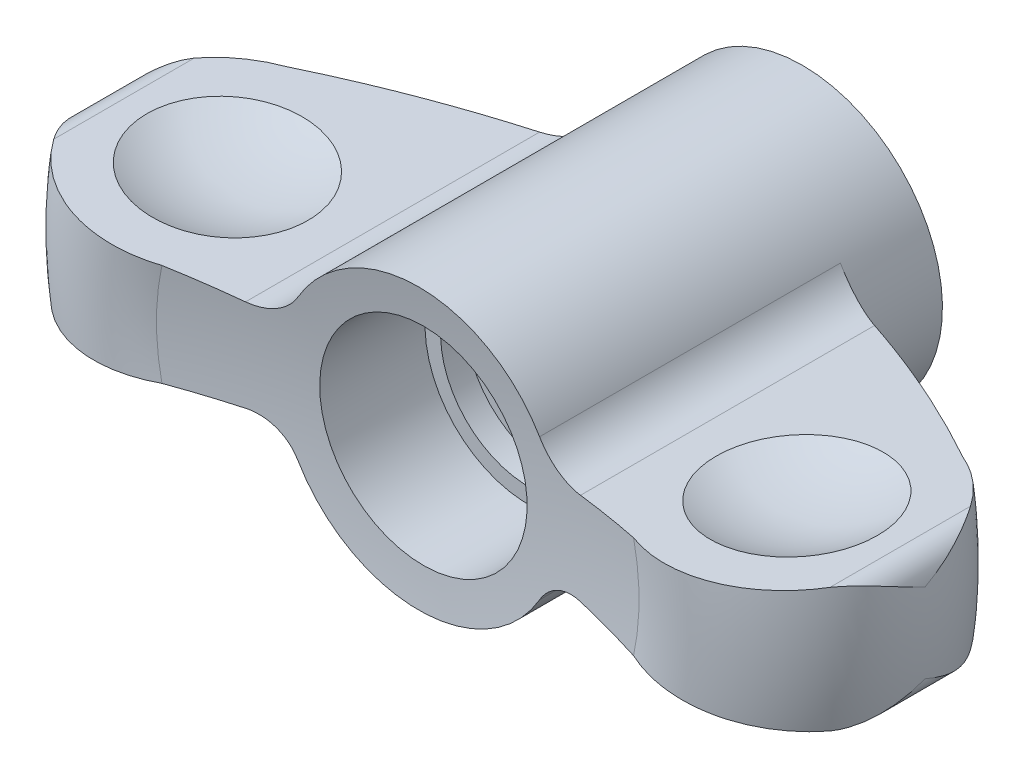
ISO-10303-21;
HEADER;
FILE_DESCRIPTION(('STEP AP214'),'2;1');
FILE_NAME('part.step','',(''),(''),'','','');
FILE_SCHEMA(('AUTOMOTIVE_DESIGN { 1 0 10303 214 1 1 1 1 }'));
ENDSEC;
DATA;
#1=APPLICATION_CONTEXT('core data for automotive mechanical design processes');
#2=APPLICATION_PROTOCOL_DEFINITION('international standard','automotive_design',2000,#1);
#3=PRODUCT_CONTEXT('',#1,'mechanical');
#4=PRODUCT('Part','Part','',(#3));
#5=PRODUCT_RELATED_PRODUCT_CATEGORY('part','',(#4));
#6=PRODUCT_DEFINITION_FORMATION('','',#4);
#7=PRODUCT_DEFINITION_CONTEXT('part definition',#1,'design');
#8=PRODUCT_DEFINITION('design','',#6,#7);
#9=PRODUCT_DEFINITION_SHAPE('','',#8);
#10=(LENGTH_UNIT() NAMED_UNIT(*) SI_UNIT(.MILLI.,.METRE.));
#11=(NAMED_UNIT(*) PLANE_ANGLE_UNIT() SI_UNIT($,.RADIAN.));
#12=(NAMED_UNIT(*) SI_UNIT($,.STERADIAN.) SOLID_ANGLE_UNIT());
#13=UNCERTAINTY_MEASURE_WITH_UNIT(LENGTH_MEASURE(1.E-05),#10,'distance_accuracy_value','');
#14=(GEOMETRIC_REPRESENTATION_CONTEXT(3) GLOBAL_UNCERTAINTY_ASSIGNED_CONTEXT((#13)) GLOBAL_UNIT_ASSIGNED_CONTEXT((#10,
#11,#12)) REPRESENTATION_CONTEXT('',''));
#15=CARTESIAN_POINT('',(0.,0.,0.));
#16=DIRECTION('',(0.,0.,1.));
#17=DIRECTION('',(1.,0.,0.));
#18=AXIS2_PLACEMENT_3D('',#15,#16,#17);
#19=CARTESIAN_POINT('',(0.,0.,14.));
#20=DIRECTION('',(0.,0.,1.));
#21=DIRECTION('',(0.,1.,0.));
#22=AXIS2_PLACEMENT_3D('',#19,#20,#21);
#23=TOROIDAL_SURFACE('',#22,14.,6.);
#24=CARTESIAN_POINT('',(-8.07577895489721,-2.22153257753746,16.089967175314));
#25=CARTESIAN_POINT('',(-8.13571126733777,-2.22591836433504,16.2486548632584));
#26=CARTESIAN_POINT('',(-8.20244736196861,-2.23080204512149,16.4047481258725));
#27=CARTESIAN_POINT('',(-8.34889557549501,-2.24151897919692,16.7106643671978));
#28=CARTESIAN_POINT('',(-8.42860584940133,-2.24735209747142,16.8604882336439));
#29=CARTESIAN_POINT('',(-8.600287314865,-2.25991557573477,17.1526581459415));
#30=CARTESIAN_POINT('',(-8.69224398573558,-2.26664487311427,17.295012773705));
#31=CARTESIAN_POINT('',(-8.88777572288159,-2.28095369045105,17.5714613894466));
#32=CARTESIAN_POINT('',(-8.99135096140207,-2.28853322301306,17.7055552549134));
#33=CARTESIAN_POINT('',(-9.20932263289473,-2.30448417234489,17.9645438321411));
#34=CARTESIAN_POINT('',(-9.3237170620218,-2.31285544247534,18.0894402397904));
#35=CARTESIAN_POINT('',(-9.56255081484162,-2.33033305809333,18.3292625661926));
#36=CARTESIAN_POINT('',(-9.6869938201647,-2.33943967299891,18.4441847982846));
#37=CARTESIAN_POINT('',(-9.94495008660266,-2.35831665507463,18.6631925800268));
#38=CARTESIAN_POINT('',(-10.0784600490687,-2.36808678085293,18.7672820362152));
#39=CARTESIAN_POINT('',(-10.3537001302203,-2.388228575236,18.9640051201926));
#40=CARTESIAN_POINT('',(-10.4954332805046,-2.39860046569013,19.0566344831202));
#41=CARTESIAN_POINT('',(-10.787542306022,-2.41997671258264,19.2306296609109));
#42=CARTESIAN_POINT('',(-10.9379904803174,-2.43098635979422,19.3118734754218));
#43=CARTESIAN_POINT('',(-11.245211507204,-2.45346848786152,19.4614446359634));
#44=CARTESIAN_POINT('',(-11.4019866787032,-2.46494113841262,19.5297671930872));
#45=CARTESIAN_POINT('',(-11.72066608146,-2.4882617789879,19.6529586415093));
#46=CARTESIAN_POINT('',(-11.8825690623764,-2.50010967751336,19.7078307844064));
#47=CARTESIAN_POINT('',(-12.2104566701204,-2.5241041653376,19.8037627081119));
#48=CARTESIAN_POINT('',(-12.3764426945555,-2.5362508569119,19.8448176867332));
#49=CARTESIAN_POINT('',(-12.7117974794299,-2.56079178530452,19.9128910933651));
#50=CARTESIAN_POINT('',(-12.881175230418,-2.57318668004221,19.9398650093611));
#51=CARTESIAN_POINT('',(-13.2215978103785,-2.59809846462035,19.9793695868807));
#52=CARTESIAN_POINT('',(-13.3926426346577,-2.61061535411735,19.991900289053));
#53=CARTESIAN_POINT('',(-13.7351946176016,-2.63568296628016,20.0024088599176));
#54=CARTESIAN_POINT('',(-13.9067018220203,-2.6482336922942,20.000385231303));
#55=CARTESIAN_POINT('',(-14.2488681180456,-2.67327308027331,19.9817773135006));
#56=CARTESIAN_POINT('',(-14.419527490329,-2.68576176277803,19.9651982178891));
#57=CARTESIAN_POINT('',(-14.7582027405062,-2.71054567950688,19.9176711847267));
#58=CARTESIAN_POINT('',(-14.9262260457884,-2.72284145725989,19.8867764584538));
#59=CARTESIAN_POINT('',(-15.2589992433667,-2.74719346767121,19.8108504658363));
#60=CARTESIAN_POINT('',(-15.4237503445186,-2.7592497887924,19.7658245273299));
#61=CARTESIAN_POINT('',(-15.7489475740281,-2.78304739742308,19.6619051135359));
#62=CARTESIAN_POINT('',(-15.9093911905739,-2.7947885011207,19.6030037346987));
#63=CARTESIAN_POINT('',(-16.2246513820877,-2.81785892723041,19.471777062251));
#64=CARTESIAN_POINT('',(-16.3794700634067,-2.82918840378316,19.3994568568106));
#65=CARTESIAN_POINT('',(-16.6816346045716,-2.85130050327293,19.2422894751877));
#66=CARTESIAN_POINT('',(-16.8290148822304,-2.86208564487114,19.1575088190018));
#67=CARTESIAN_POINT('',(-17.1160328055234,-2.88308932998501,18.9757734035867));
#68=CARTESIAN_POINT('',(-17.2556733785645,-2.89330808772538,18.8788232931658));
#69=CARTESIAN_POINT('',(-17.5261558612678,-2.91310172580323,18.6734849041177));
#70=CARTESIAN_POINT('',(-17.6570043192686,-2.92267708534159,18.5651052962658));
#71=CARTESIAN_POINT('',(-17.9090214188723,-2.94111944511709,18.3376563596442));
#72=CARTESIAN_POINT('',(-18.0301938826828,-2.94998672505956,18.2185912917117));
#73=CARTESIAN_POINT('',(-18.2495547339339,-2.96603933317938,17.9839289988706));
#74=CARTESIAN_POINT('',(-18.3488135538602,-2.97330299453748,17.8693353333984));
#75=CARTESIAN_POINT('',(-18.5382241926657,-2.98716387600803,17.633156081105));
#76=CARTESIAN_POINT('',(-18.6283920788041,-2.99376227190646,17.5115834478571));
#77=CARTESIAN_POINT('',(-18.7138313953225,-3.00001463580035,17.3867458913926));
#78=B_SPLINE_CURVE_WITH_KNOTS('',3,(#24,#25,#26,#27,#28,#29,#30,#31,#32,#33,#34,#35,#36,#37,#38,
#39,#40,#41,#42,#43,#44,#45,#46,#47,#48,#49,#50,#51,#52,#53,#54,#55,#56,#57,#58,#59,#60,#61,#62,
#63,#64,#65,#66,#67,#68,#69,#70,#71,#72,#73,#74,#75,#76,#77),.UNSPECIFIED.,.F.,.F.,(4,2,2,2,2,2,
2,2,2,2,2,2,2,2,2,2,2,2,2,2,2,2,2,2,2,2,4),(0.,0.508884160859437,1.01769601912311,
1.52590985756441,2.03413123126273,2.5422586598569,3.05057310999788,3.55870361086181,
4.06702264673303,4.58042882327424,5.09402490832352,5.60749671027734,6.12114678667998,
6.63641089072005,7.15167354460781,7.66698920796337,8.18212107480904,8.69535336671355,
9.20839238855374,9.72172435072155,10.2348620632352,10.7453537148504,11.2556509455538,
11.7655637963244,12.2752742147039,12.7301813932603,13.1842699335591),.UNSPECIFIED.);
#79=CARTESIAN_POINT('',(-11.3708969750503,-2.46266602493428,19.5140273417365));
#80=VERTEX_POINT('',#79);
#81=CARTESIAN_POINT('',(-18.7136313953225,-3.,17.387038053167));
#82=VERTEX_POINT('',#81);
#83=EDGE_CURVE('E171',#80,#82,#78,.T.);
#84=ORIENTED_EDGE('',*,*,#83,.F.);
#85=CARTESIAN_POINT('',(0.,0.,19.5140273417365));
#86=DIRECTION('',(0.,0.,1.));
#87=DIRECTION('',(0.,1.,0.));
#88=AXIS2_PLACEMENT_3D('',#85,#86,#87);
#89=CIRCLE('',#88,11.6345185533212);
#90=CARTESIAN_POINT('',(-11.3708969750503,2.46266602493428,19.5140273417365));
#91=VERTEX_POINT('',#90);
#92=EDGE_CURVE('E188',#91,#80,#89,.T.);
#93=ORIENTED_EDGE('',*,*,#92,.F.);
#94=CARTESIAN_POINT('',(-18.7138313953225,3.00001463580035,17.3867458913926));
#95=CARTESIAN_POINT('',(-18.6183948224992,2.99303068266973,17.5262020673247));
#96=CARTESIAN_POINT('',(-18.5170456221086,2.98561404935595,17.6615847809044));
#97=CARTESIAN_POINT('',(-18.3033246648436,2.96997416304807,17.9232863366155));
#98=CARTESIAN_POINT('',(-18.1909536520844,2.96175096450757,18.0496057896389));
#99=CARTESIAN_POINT('',(-17.9560842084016,2.94456345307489,18.2921739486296));
#100=CARTESIAN_POINT('',(-17.833594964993,2.93559981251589,18.4084315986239));
#101=CARTESIAN_POINT('',(-17.57928817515,2.91698989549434,18.6301894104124));
#102=CARTESIAN_POINT('',(-17.4474706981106,2.90734362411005,18.7356896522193));
#103=CARTESIAN_POINT('',(-17.1754253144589,2.88743561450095,18.9352145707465));
#104=CARTESIAN_POINT('',(-17.0351958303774,2.87717376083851,19.0292370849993));
#105=CARTESIAN_POINT('',(-16.7472989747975,2.85610575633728,19.2051641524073));
#106=CARTESIAN_POINT('',(-16.59962887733,2.84529940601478,19.2870642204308));
#107=CARTESIAN_POINT('',(-16.2980287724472,2.82322861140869,19.4381030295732));
#108=CARTESIAN_POINT('',(-16.14410199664,2.81196440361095,19.507248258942));
#109=CARTESIAN_POINT('',(-15.8309527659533,2.78904845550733,19.6323826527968));
#110=CARTESIAN_POINT('',(-15.6717283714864,2.77739657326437,19.6883669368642));
#111=CARTESIAN_POINT('',(-15.3486891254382,2.75375688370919,19.7869170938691));
#112=CARTESIAN_POINT('',(-15.1848621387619,2.74176818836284,19.829442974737));
#113=CARTESIAN_POINT('',(-14.8541688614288,2.7175683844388,19.9005851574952));
#114=CARTESIAN_POINT('',(-14.6873014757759,2.70535719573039,19.9291963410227));
#115=CARTESIAN_POINT('',(-14.3517968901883,2.68080530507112,19.9723018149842));
#116=CARTESIAN_POINT('',(-14.1831600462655,2.66846462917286,19.9867988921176));
#117=CARTESIAN_POINT('',(-13.8452097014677,2.64373376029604,20.0016086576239));
#118=CARTESIAN_POINT('',(-13.6758959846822,2.63134355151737,20.0019163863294));
#119=CARTESIAN_POINT('',(-13.3368935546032,2.60653569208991,19.9883160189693));
#120=CARTESIAN_POINT('',(-13.1672079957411,2.59411827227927,19.9743288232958));
#121=CARTESIAN_POINT('',(-12.8296040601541,2.5694127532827,19.9321365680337));
#122=CARTESIAN_POINT('',(-12.6616856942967,2.55712465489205,19.9039314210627));
#123=CARTESIAN_POINT('',(-12.3287760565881,2.53276265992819,19.8335149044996));
#124=CARTESIAN_POINT('',(-12.1637851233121,2.52068878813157,19.791301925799));
#125=CARTESIAN_POINT('',(-11.8379611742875,2.49684531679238,19.6931974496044));
#126=CARTESIAN_POINT('',(-11.6771267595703,2.4850756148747,19.637310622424));
#127=CARTESIAN_POINT('',(-11.359754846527,2.46185065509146,19.5118849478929));
#128=CARTESIAN_POINT('',(-11.2032479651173,2.4503976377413,19.4422681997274));
#129=CARTESIAN_POINT('',(-10.896681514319,2.42796341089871,19.2901159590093));
#130=CARTESIAN_POINT('',(-10.7466196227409,2.41698203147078,19.2075851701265));
#131=CARTESIAN_POINT('',(-10.4538518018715,2.39555757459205,19.0301080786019));
#132=CARTESIAN_POINT('',(-10.3111507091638,2.38511485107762,18.9351537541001));
#133=CARTESIAN_POINT('',(-10.0342820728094,2.36485388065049,18.7335700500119));
#134=CARTESIAN_POINT('',(-9.90011136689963,2.35503540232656,18.6269450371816));
#135=CARTESIAN_POINT('',(-9.64091208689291,2.33606745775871,18.4024655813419));
#136=CARTESIAN_POINT('',(-9.51590567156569,2.32691961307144,18.2845854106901));
#137=CARTESIAN_POINT('',(-9.27635191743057,2.30938930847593,18.0386715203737));
#138=CARTESIAN_POINT('',(-9.16180061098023,2.30100655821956,17.9106416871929));
#139=CARTESIAN_POINT('',(-8.94405979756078,2.28507250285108,17.6453914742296));
#140=CARTESIAN_POINT('',(-8.84086084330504,2.27752050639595,17.5081788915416));
#141=CARTESIAN_POINT('',(-8.64654911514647,2.263300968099,17.2254791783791));
#142=CARTESIAN_POINT('',(-8.55543144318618,2.25663306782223,17.0799954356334));
#143=CARTESIAN_POINT('',(-8.39408042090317,2.24482556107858,16.7960165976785));
#144=CARTESIAN_POINT('',(-8.32268295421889,2.23960076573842,16.6581850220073));
#145=CARTESIAN_POINT('',(-8.19090704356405,2.22995753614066,16.3776074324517));
#146=CARTESIAN_POINT('',(-8.13051034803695,2.22553776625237,16.2348700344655));
#147=CARTESIAN_POINT('',(-8.0757789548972,2.22153257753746,16.089967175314));
#148=B_SPLINE_CURVE_WITH_KNOTS('',3,(#94,#95,#96,#97,#98,#99,#100,#101,#102,#103,#104,#105,#106,
#107,#108,#109,#110,#111,#112,#113,#114,#115,#116,#117,#118,#119,#120,#121,#122,#123,#124,#125,
#126,#127,#128,#129,#130,#131,#132,#133,#134,#135,#136,#137,#138,#139,#140,#141,#142,#143,#144,
#145,#146,#147),.UNSPECIFIED.,.F.,.F.,(4,2,2,2,2,2,2,2,2,2,2,2,2,2,2,2,2,2,2,2,2,2,2,2,2,2,4),
(0.,0.507232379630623,1.01443053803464,1.52117311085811,2.02791191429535,2.53474604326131,
3.04176722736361,3.54852977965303,4.05547995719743,4.5639227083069,5.07255234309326,
5.58108153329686,6.08978847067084,6.60132561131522,7.11286589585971,7.62446496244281,
8.13588953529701,8.65030393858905,9.16453141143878,9.67909257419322,10.1934618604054,
10.7090364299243,11.2244145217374,11.7393604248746,12.2540969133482,12.7195750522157,
13.184273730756),.UNSPECIFIED.);
#149=CARTESIAN_POINT('',(-18.7136313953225,3.,17.3870380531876));
#150=VERTEX_POINT('',#149);
#151=EDGE_CURVE('E292',#150,#91,#148,.T.);
#152=ORIENTED_EDGE('',*,*,#151,.F.);
#153=CARTESIAN_POINT('',(-19.9081185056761,1.91489361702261,14.));
#154=CARTESIAN_POINT('',(-19.9079114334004,1.91704653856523,14.0046889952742));
#155=CARTESIAN_POINT('',(-19.9076985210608,1.91919899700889,14.0093781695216));
#156=CARTESIAN_POINT('',(-19.8915053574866,2.07850005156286,14.3565101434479));
#157=CARTESIAN_POINT('',(-19.8443969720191,2.23304389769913,14.6998619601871));
#158=CARTESIAN_POINT('',(-19.7280454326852,2.44617267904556,15.2114895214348));
#159=CARTESIAN_POINT('',(-19.6816080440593,2.51413382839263,15.3815593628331));
#160=CARTESIAN_POINT('',(-19.5735019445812,2.64117148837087,15.720267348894));
#161=CARTESIAN_POINT('',(-19.5118395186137,2.70025164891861,15.888906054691));
#162=CARTESIAN_POINT('',(-19.3955603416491,2.78918463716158,16.1703169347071));
#163=CARTESIAN_POINT('',(-19.3449829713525,2.82234574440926,16.2837302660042));
#164=CARTESIAN_POINT('',(-19.2369910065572,2.88161292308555,16.5090460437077));
#165=CARTESIAN_POINT('',(-19.179582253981,2.90772496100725,16.6209496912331));
#166=CARTESIAN_POINT('',(-19.0577740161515,2.95142281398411,16.8434399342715));
#167=CARTESIAN_POINT('',(-18.9933401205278,2.96896412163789,16.9540168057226));
#168=CARTESIAN_POINT('',(-18.891908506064,2.9871816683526,17.117995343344));
#169=CARTESIAN_POINT('',(-18.8572512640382,2.99190599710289,17.1724123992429));
#170=CARTESIAN_POINT('',(-18.7864388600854,2.99831558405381,17.2804796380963));
#171=CARTESIAN_POINT('',(-18.7502829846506,2.99999937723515,17.3341294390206));
#172=CARTESIAN_POINT('',(-18.7134313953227,2.99999998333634,17.387326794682));
#173=B_SPLINE_CURVE_WITH_KNOTS('',3,(#153,#154,#155,#156,#157,#158,#159,#160,#161,#162,#163,
#164,#165,#166,#167,#168,#169,#170,#171,#172),.UNSPECIFIED.,.F.,.F.,(4,2,2,2,2,2,2,2,2,4),(0.,
0.0154919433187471,1.14680177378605,1.71308946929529,2.27914379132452,2.66441448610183,
3.04935804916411,3.43627990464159,3.63026400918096,3.82434155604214),.UNSPECIFIED.);
#174=CARTESIAN_POINT('',(-19.9081184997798,1.91489367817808,14.));
#175=VERTEX_POINT('',#174);
#176=EDGE_CURVE('E349',#175,#150,#173,.T.);
#177=ORIENTED_EDGE('',*,*,#176,.F.);
#178=CARTESIAN_POINT('',(-18.7134313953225,2.99999998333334,10.6126732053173));
#179=CARTESIAN_POINT('',(-18.7715181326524,2.99996757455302,10.6965080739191));
#180=CARTESIAN_POINT('',(-18.8278479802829,2.99580634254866,10.7814514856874));
#181=CARTESIAN_POINT('',(-18.9366068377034,2.98038840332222,10.9529949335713));
#182=CARTESIAN_POINT('',(-18.9890419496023,2.96914306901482,11.0395920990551));
#183=CARTESIAN_POINT('',(-19.0895870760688,2.94077514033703,11.2137637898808));
#184=CARTESIAN_POINT('',(-19.1377153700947,2.92367903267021,11.3013322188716));
#185=CARTESIAN_POINT('',(-19.2297916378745,2.88447422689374,11.4775843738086));
#186=CARTESIAN_POINT('',(-19.2737371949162,2.86236265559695,11.5662687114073));
#187=CARTESIAN_POINT('',(-19.3825891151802,2.79925245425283,11.7983475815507));
#188=CARTESIAN_POINT('',(-19.4441235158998,2.75491275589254,11.942433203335));
#189=CARTESIAN_POINT('',(-19.5559564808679,2.65788785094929,12.2320980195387));
#190=CARTESIAN_POINT('',(-19.606250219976,2.6051990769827,12.3776778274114));
#191=CARTESIAN_POINT('',(-19.7403065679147,2.43752228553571,12.8164900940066));
#192=CARTESIAN_POINT('',(-19.8071211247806,2.31300292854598,13.1115318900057));
#193=CARTESIAN_POINT('',(-19.8652951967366,2.14013350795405,13.5033189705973));
#194=CARTESIAN_POINT('',(-19.8771709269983,2.09693746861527,13.599846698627));
#195=CARTESIAN_POINT('',(-19.8960094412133,2.00968934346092,13.792900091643));
#196=CARTESIAN_POINT('',(-19.9029780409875,1.96563833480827,13.8894256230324));
#197=CARTESIAN_POINT('',(-19.9076985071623,1.919199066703,13.9906217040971));
#198=CARTESIAN_POINT('',(-19.9079114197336,1.9170466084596,13.9953108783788));
#199=CARTESIAN_POINT('',(-19.9081185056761,1.91489361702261,14.));
#200=B_SPLINE_CURVE_WITH_KNOTS('',3,(#178,#179,#180,#181,#182,#183,#184,#185,#186,#187,#188,
#189,#190,#191,#192,#193,#194,#195,#196,#197,#198,#199),.UNSPECIFIED.,.F.,.F.,(4,2,2,2,2,2,2,2,
2,2,4),(0.,0.305743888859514,0.610998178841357,0.914888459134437,1.21895326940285,
1.70667556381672,2.19460681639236,3.17136359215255,3.49057583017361,3.80940910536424,
3.8249010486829),.UNSPECIFIED.);
#201=CARTESIAN_POINT('',(-18.7136313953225,3.,10.6129619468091));
#202=VERTEX_POINT('',#201);
#203=EDGE_CURVE('E342',#202,#175,#200,.T.);
#204=ORIENTED_EDGE('',*,*,#203,.F.);
#205=CARTESIAN_POINT('',(-16.2920922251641,2.82279418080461,8.56174085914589));
#206=CARTESIAN_POINT('',(-16.4467421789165,2.83411131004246,8.6336460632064));
#207=CARTESIAN_POINT('',(-16.5983293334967,2.84520430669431,8.71217190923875));
#208=CARTESIAN_POINT('',(-16.8943515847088,2.86686691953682,8.88186310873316));
#209=CARTESIAN_POINT('',(-17.0387846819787,2.87743638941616,8.97303196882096));
#210=CARTESIAN_POINT('',(-17.3162983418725,2.89774456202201,9.1652288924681));
#211=CARTESIAN_POINT('',(-17.449558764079,2.90749642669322,9.26599590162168));
#212=CARTESIAN_POINT('',(-17.707191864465,2.92634975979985,9.4782649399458));
#213=CARTESIAN_POINT('',(-17.8315679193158,2.9354514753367,9.58976285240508));
#214=CARTESIAN_POINT('',(-18.0917831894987,2.95449376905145,9.84341713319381));
#215=CARTESIAN_POINT('',(-18.2257549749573,2.96429769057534,9.98750697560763));
#216=CARTESIAN_POINT('',(-18.4806397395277,2.98294990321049,10.2901511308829));
#217=CARTESIAN_POINT('',(-18.601356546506,2.99178383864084,10.4488715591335));
#218=CARTESIAN_POINT('',(-18.7138313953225,3.00001463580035,10.6132541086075));
#219=B_SPLINE_CURVE_WITH_KNOTS('',3,(#205,#206,#207,#208,#209,#210,#211,#212,#213,#214,#215,
#216,#217,#218),.UNSPECIFIED.,.F.,.F.,(4,2,2,2,2,2,4),(0.,0.512618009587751,1.02537848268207,
1.52685725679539,2.02814440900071,2.61815679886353,3.21597344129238),.UNSPECIFIED.);
#220=CARTESIAN_POINT('',(-16.2925222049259,2.82282564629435,8.56194085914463));
#221=VERTEX_POINT('',#220);
#222=EDGE_CURVE('E283',#221,#202,#219,.T.);
#223=ORIENTED_EDGE('',*,*,#222,.F.);
#224=CARTESIAN_POINT('',(0.,0.,8.56194085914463));
#225=DIRECTION('',(0.,0.,1.));
#226=DIRECTION('',(0.,1.,0.));
#227=AXIS2_PLACEMENT_3D('',#224,#225,#226);
#228=CIRCLE('',#227,16.5352539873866);
#229=CARTESIAN_POINT('',(-16.292522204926,-2.82282564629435,8.56194085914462));
#230=VERTEX_POINT('',#229);
#231=EDGE_CURVE('E184',#221,#230,#228,.T.);
#232=ORIENTED_EDGE('',*,*,#231,.T.);
#233=CARTESIAN_POINT('',(-19.4524589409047,-3.05406666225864,12.0985771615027));
#234=CARTESIAN_POINT('',(-19.4084868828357,-3.05084883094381,11.9670841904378));
#235=CARTESIAN_POINT('',(-19.3599787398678,-3.04729905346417,11.8371780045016));
#236=CARTESIAN_POINT('',(-19.2540981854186,-3.03955082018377,11.5810708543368));
#237=CARTESIAN_POINT('',(-19.196727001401,-3.03535245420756,11.4548693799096));
#238=CARTESIAN_POINT('',(-19.011467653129,-3.02179536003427,11.0822780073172));
#239=CARTESIAN_POINT('',(-18.8705363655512,-3.01148214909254,10.84220786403));
#240=CARTESIAN_POINT('',(-18.6183201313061,-2.99302521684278,10.473707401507));
#241=CARTESIAN_POINT('',(-18.5169491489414,-2.98560698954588,10.3382902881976));
#242=CARTESIAN_POINT('',(-18.3031692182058,-2.96996278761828,10.0765301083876));
#243=CARTESIAN_POINT('',(-18.1907635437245,-2.96173705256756,9.95018436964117));
#244=CARTESIAN_POINT('',(-17.9558508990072,-2.9445463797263,9.70759861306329));
#245=CARTESIAN_POINT('',(-17.8333551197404,-2.93558226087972,9.59134768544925));
#246=CARTESIAN_POINT('',(-17.5790797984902,-2.91697464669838,9.36964046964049));
#247=CARTESIAN_POINT('',(-17.4473032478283,-2.90733137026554,9.26418072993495));
#248=CARTESIAN_POINT('',(-17.1519065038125,-2.88571453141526,9.04754412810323));
#249=CARTESIAN_POINT('',(-16.986712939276,-2.87362583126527,8.93851572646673));
#250=CARTESIAN_POINT('',(-16.6464037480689,-2.84872234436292,8.73728440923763));
#251=CARTESIAN_POINT('',(-16.4712869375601,-2.83590747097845,8.64508350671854));
#252=CARTESIAN_POINT('',(-16.1379405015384,-2.81151351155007,8.4900455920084));
#253=CARTESIAN_POINT('',(-15.9807710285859,-2.80001200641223,8.42490565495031));
#254=CARTESIAN_POINT('',(-15.6614428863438,-2.77664389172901,8.30814524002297));
#255=CARTESIAN_POINT('',(-15.4992824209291,-2.764777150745,8.25652969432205));
#256=CARTESIAN_POINT('',(-15.1710899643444,-2.7407603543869,8.16717388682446));
#257=CARTESIAN_POINT('',(-15.0050555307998,-2.72861012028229,8.12944264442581));
#258=CARTESIAN_POINT('',(-14.6703977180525,-2.70412019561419,8.06814307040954));
#259=CARTESIAN_POINT('',(-14.501774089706,-2.69178048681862,8.04457611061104));
#260=CARTESIAN_POINT('',(-14.1300060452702,-2.66457487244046,8.00855913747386));
#261=CARTESIAN_POINT('',(-13.9265588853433,-2.64968681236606,7.99918402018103));
#262=CARTESIAN_POINT('',(-13.5202907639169,-2.61995651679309,8.00092804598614));
#263=CARTESIAN_POINT('',(-13.3174695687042,-2.60511426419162,8.01199308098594));
#264=CARTESIAN_POINT('',(-13.115736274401,-2.59035162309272,8.03326324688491));
#265=B_SPLINE_CURVE_WITH_KNOTS('',3,(#233,#234,#235,#236,#237,#238,#239,#240,#241,#242,#243,
#244,#245,#246,#247,#248,#249,#250,#251,#252,#253,#254,#255,#256,#257,#258,#259,#260,#261,#262,
#263,#264),.UNSPECIFIED.,.F.,.F.,(4,2,2,2,2,2,2,2,2,2,2,2,2,2,2,4),(0.,0.415862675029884,
0.831667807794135,1.66424050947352,2.17169136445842,2.67899211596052,3.18573760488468,
3.69232050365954,4.28623239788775,4.88021529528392,5.39118733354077,5.90234545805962,
6.41383505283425,6.92537417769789,7.5369392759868,8.14688779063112),.UNSPECIFIED.);
#266=CARTESIAN_POINT('',(-18.7136313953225,-3.,10.6129619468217));
#267=VERTEX_POINT('',#266);
#268=EDGE_CURVE('E300',#267,#230,#265,.T.);
#269=ORIENTED_EDGE('',*,*,#268,.F.);
#270=CARTESIAN_POINT('',(-19.9081185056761,-1.91489361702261,14.));
#271=CARTESIAN_POINT('',(-19.9079114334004,-1.91704653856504,13.9953110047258));
#272=CARTESIAN_POINT('',(-19.9076985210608,-1.91919899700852,13.9906218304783));
#273=CARTESIAN_POINT('',(-19.8915053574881,-2.078500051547,13.6434898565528));
#274=CARTESIAN_POINT('',(-19.8443969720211,-2.23304389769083,13.300138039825));
#275=CARTESIAN_POINT('',(-19.7280454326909,-2.44617267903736,12.7885104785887));
#276=CARTESIAN_POINT('',(-19.6816080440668,-2.51413382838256,12.6184406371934));
#277=CARTESIAN_POINT('',(-19.5735019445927,-2.64117148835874,12.2797326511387));
#278=CARTESIAN_POINT('',(-19.5118395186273,-2.70025164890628,12.111093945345));
#279=CARTESIAN_POINT('',(-19.3955603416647,-2.78918463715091,11.8296830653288));
#280=CARTESIAN_POINT('',(-19.3449829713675,-2.82234574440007,11.7162697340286));
#281=CARTESIAN_POINT('',(-19.2369910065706,-2.88161292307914,11.4909539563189));
#282=CARTESIAN_POINT('',(-19.1795822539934,-2.90772496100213,11.3790503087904));
#283=CARTESIAN_POINT('',(-19.0577740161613,-2.9514228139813,11.1565600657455));
#284=CARTESIAN_POINT('',(-18.9933401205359,-2.96896412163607,11.0459831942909));
#285=CARTESIAN_POINT('',(-18.8919085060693,-2.98718166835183,10.8820046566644));
#286=CARTESIAN_POINT('',(-18.8572512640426,-2.9919059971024,10.8275876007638));
#287=CARTESIAN_POINT('',(-18.7864388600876,-2.99831558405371,10.7195203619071));
#288=CARTESIAN_POINT('',(-18.7502829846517,-2.99999937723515,10.6658705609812));
#289=CARTESIAN_POINT('',(-18.7134313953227,-2.99999998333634,10.6126732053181));
#290=B_SPLINE_CURVE_WITH_KNOTS('',3,(#270,#271,#272,#273,#274,#275,#276,#277,#278,#279,#280,
#281,#282,#283,#284,#285,#286,#287,#288,#289),.UNSPECIFIED.,.F.,.F.,(4,2,2,2,2,2,2,2,2,4),(0.,
0.0154919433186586,1.14680177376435,1.71308946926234,2.27914379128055,2.66441448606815,
3.04935804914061,3.4362799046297,3.630264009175,3.82434155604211),.UNSPECIFIED.);
#291=CARTESIAN_POINT('',(-19.9081185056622,-1.91489361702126,14.));
#292=VERTEX_POINT('',#291);
#293=EDGE_CURVE('E9',#292,#267,#290,.T.);
#294=ORIENTED_EDGE('',*,*,#293,.F.);
#295=CARTESIAN_POINT('',(-18.7134313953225,-2.99999998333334,17.3873267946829));
#296=CARTESIAN_POINT('',(-18.7715181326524,-2.99996757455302,17.303491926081));
#297=CARTESIAN_POINT('',(-18.8278479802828,-2.99580634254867,17.2185485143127));
#298=CARTESIAN_POINT('',(-18.9366068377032,-2.98038840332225,17.0470050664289));
#299=CARTESIAN_POINT('',(-18.9890419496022,-2.96914306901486,16.9604079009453));
#300=CARTESIAN_POINT('',(-19.0895870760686,-2.94077514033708,16.7862362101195));
#301=CARTESIAN_POINT('',(-19.1377153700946,-2.92367903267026,16.6986677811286));
#302=CARTESIAN_POINT('',(-19.2297916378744,-2.88447422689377,16.5224156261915));
#303=CARTESIAN_POINT('',(-19.2737371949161,-2.86236265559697,16.4337312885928));
#304=CARTESIAN_POINT('',(-19.3825891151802,-2.79925245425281,16.2016524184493));
#305=CARTESIAN_POINT('',(-19.4441235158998,-2.75491275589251,16.057566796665));
#306=CARTESIAN_POINT('',(-19.5559564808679,-2.65788785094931,15.7679019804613));
#307=CARTESIAN_POINT('',(-19.606250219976,-2.60519907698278,15.6223221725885));
#308=CARTESIAN_POINT('',(-19.7403065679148,-2.43752228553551,15.1835099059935));
#309=CARTESIAN_POINT('',(-19.8071211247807,-2.3130029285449,14.8884681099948));
#310=CARTESIAN_POINT('',(-19.8652951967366,-2.1401335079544,14.4966810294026));
#311=CARTESIAN_POINT('',(-19.8771709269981,-2.09693746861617,14.4001533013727));
#312=CARTESIAN_POINT('',(-19.8960094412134,-2.00968934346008,14.2070999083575));
#313=CARTESIAN_POINT('',(-19.9029780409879,-1.96563833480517,14.1105743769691));
#314=CARTESIAN_POINT('',(-19.9076985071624,-1.91919906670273,14.0093782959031));
#315=CARTESIAN_POINT('',(-19.9079114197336,-1.91704660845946,14.0046891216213));
#316=CARTESIAN_POINT('',(-19.9081185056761,-1.91489361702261,14.));
#317=B_SPLINE_CURVE_WITH_KNOTS('',3,(#295,#296,#297,#298,#299,#300,#301,#302,#303,#304,#305,
#306,#307,#308,#309,#310,#311,#312,#313,#314,#315,#316),.UNSPECIFIED.,.F.,.F.,(4,2,2,2,2,2,2,2,
2,2,4),(0.,0.305743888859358,0.610998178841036,0.914888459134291,1.21895326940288,
1.70667556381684,2.19460681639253,3.17136359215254,3.49057583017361,3.80940910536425,
3.82490104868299),.UNSPECIFIED.);
#318=EDGE_CURVE('E23',#82,#292,#317,.T.);
#319=ORIENTED_EDGE('',*,*,#318,.F.);
#320=EDGE_LOOP('',(#84,#93,#152,#177,#204,#223,#232,#269,#294,#319));
#321=FACE_BOUND('',#320,.T.);
#322=ADVANCED_FACE('F14',(#321),#23,.T.);
#323=CARTESIAN_POINT('',(0.,0.,55.6815128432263));
#324=DIRECTION('',(0.,0.,1.));
#325=DIRECTION('',(0.,1.,0.));
#326=AXIS2_PLACEMENT_3D('',#323,#324,#325);
#327=DEGENERATE_TOROIDAL_SURFACE('',#326,11.3881858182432,54.7720052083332,.F.);
#328=CARTESIAN_POINT('',(0.,0.,4.));
#329=DIRECTION('',(0.,0.,1.));
#330=DIRECTION('',(0.,1.,0.));
#331=AXIS2_PLACEMENT_3D('',#328,#329,#330);
#332=CIRCLE('',#331,6.75);
#333=CARTESIAN_POINT('',(5.82847209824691,-3.40461642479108,4.));
#334=VERTEX_POINT('',#333);
#335=CARTESIAN_POINT('',(5.82847209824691,3.40461642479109,4.));
#336=VERTEX_POINT('',#335);
#337=EDGE_CURVE('E157',#334,#336,#332,.T.);
#338=ORIENTED_EDGE('',*,*,#337,.T.);
#339=CARTESIAN_POINT('',(5.8283552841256,3.40481642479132,4.00000000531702));
#340=CARTESIAN_POINT('',(5.86016751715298,3.35032489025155,3.99999042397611));
#341=CARTESIAN_POINT('',(5.8941420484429,3.2971027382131,4.00117787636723));
#342=CARTESIAN_POINT('',(5.96610721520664,3.1935785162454,4.00589618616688));
#343=CARTESIAN_POINT('',(6.00409668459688,3.143275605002,4.00942636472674));
#344=CARTESIAN_POINT('',(6.08365962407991,3.04611307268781,4.01876280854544));
#345=CARTESIAN_POINT('',(6.12521980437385,2.99924179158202,4.02456089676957));
#346=CARTESIAN_POINT('',(6.21168420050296,2.90905886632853,4.03833435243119));
#347=CARTESIAN_POINT('',(6.25658853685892,2.86574735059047,4.0463097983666));
#348=CARTESIAN_POINT('',(6.39572240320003,2.7416234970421,4.07331947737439));
#349=CARTESIAN_POINT('',(6.49450423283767,2.6664622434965,4.09545290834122));
#350=CARTESIAN_POINT('',(6.70110436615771,2.53287297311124,4.14678976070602));
#351=CARTESIAN_POINT('',(6.80892945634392,2.47445767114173,4.17599852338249));
#352=CARTESIAN_POINT('',(7.03563426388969,2.37292590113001,4.24159895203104));
#353=CARTESIAN_POINT('',(7.15479202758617,2.33060088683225,4.27825129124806));
#354=CARTESIAN_POINT('',(7.3967458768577,2.26533647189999,4.35639988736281));
#355=CARTESIAN_POINT('',(7.51954158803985,2.24239508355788,4.39789564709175));
#356=CARTESIAN_POINT('',(7.7150978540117,2.221232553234,4.46655020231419));
#357=CARTESIAN_POINT('',(7.78764059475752,2.21672214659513,4.49257664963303));
#358=CARTESIAN_POINT('',(7.93230052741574,2.21426652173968,4.54553902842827));
#359=CARTESIAN_POINT('',(8.0044183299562,2.21630490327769,4.57247252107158));
#360=CARTESIAN_POINT('',(8.07617895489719,2.22156185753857,4.5997811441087));
#361=B_SPLINE_CURVE_WITH_KNOTS('',3,(#339,#340,#341,#342,#343,#344,#345,#346,#347,#348,#349,
#350,#351,#352,#353,#354,#355,#356,#357,#358,#359,#360),.UNSPECIFIED.,.F.,.F.,(4,2,2,2,2,2,2,2,
2,2,4),(0.,0.189223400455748,0.378391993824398,0.56688472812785,0.755384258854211,
1.13176907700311,1.50843892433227,1.90177824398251,2.29507722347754,2.5264257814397,
2.75719542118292),.UNSPECIFIED.);
#362=CARTESIAN_POINT('',(8.07597895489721,2.22154721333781,4.59970502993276));
#363=VERTEX_POINT('',#362);
#364=EDGE_CURVE('E146',#336,#363,#361,.T.);
#365=ORIENTED_EDGE('',*,*,#364,.T.);
#366=CARTESIAN_POINT('',(16.2928604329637,2.82285039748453,8.56214085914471));
#367=CARTESIAN_POINT('',(15.6369909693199,2.77485452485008,8.1743136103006));
#368=CARTESIAN_POINT('',(14.9729918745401,2.72626373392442,7.80032225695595));
#369=CARTESIAN_POINT('',(13.6310611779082,2.62806258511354,7.08139968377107));
#370=CARTESIAN_POINT('',(12.9531567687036,2.57845421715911,6.73641743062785));
#371=CARTESIAN_POINT('',(11.5833597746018,2.47821384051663,6.07549394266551));
#372=CARTESIAN_POINT('',(10.8914668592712,2.42758180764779,5.75955339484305));
#373=CARTESIAN_POINT('',(9.84342332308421,2.35088702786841,5.30782495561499));
#374=CARTESIAN_POINT('',(9.49204497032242,2.32517351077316,5.1608201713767));
#375=CARTESIAN_POINT('',(8.78619975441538,2.27352046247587,4.87445661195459));
#376=CARTESIAN_POINT('',(8.4317328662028,2.24758092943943,4.73509789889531));
#377=CARTESIAN_POINT('',(8.07577895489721,2.22153257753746,4.59962891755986));
#378=B_SPLINE_CURVE_WITH_KNOTS('',3,(#366,#367,#368,#369,#370,#371,#372,#373,#374,#375,#376,
#377),.UNSPECIFIED.,.F.,.F.,(4,2,2,2,2,4),(0.,2.29020852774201,4.57629990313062,
6.86244534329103,8.00763897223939,9.15284190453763),.UNSPECIFIED.);
#379=CARTESIAN_POINT('',(16.2925222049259,2.82282564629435,8.56194085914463));
#380=VERTEX_POINT('',#379);
#381=EDGE_CURVE('E211',#380,#363,#378,.T.);
#382=ORIENTED_EDGE('',*,*,#381,.F.);
#383=CARTESIAN_POINT('',(16.2925222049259,-2.82282564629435,8.56194085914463));
#384=VERTEX_POINT('',#383);
#385=EDGE_CURVE('E183',#384,#380,#228,.T.);
#386=ORIENTED_EDGE('',*,*,#385,.F.);
#387=CARTESIAN_POINT('',(8.07577895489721,-2.22153257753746,4.59962891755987));
#388=CARTESIAN_POINT('',(8.43173286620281,-2.24758092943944,4.73509789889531));
#389=CARTESIAN_POINT('',(8.78619975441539,-2.27352046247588,4.87445661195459));
#390=CARTESIAN_POINT('',(9.49204497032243,-2.32517351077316,5.16082017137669));
#391=CARTESIAN_POINT('',(9.84342332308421,-2.35088702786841,5.30782495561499));
#392=CARTESIAN_POINT('',(10.8914668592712,-2.4275818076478,5.75955339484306));
#393=CARTESIAN_POINT('',(11.5833597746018,-2.47821384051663,6.07549394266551));
#394=CARTESIAN_POINT('',(12.9531567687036,-2.57845421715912,6.73641743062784));
#395=CARTESIAN_POINT('',(13.6310611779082,-2.62806258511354,7.08139968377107));
#396=CARTESIAN_POINT('',(14.9729918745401,-2.72626373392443,7.80032225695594));
#397=CARTESIAN_POINT('',(15.6369909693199,-2.77485452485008,8.1743136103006));
#398=CARTESIAN_POINT('',(16.2928604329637,-2.82285039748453,8.56214085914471));
#399=B_SPLINE_CURVE_WITH_KNOTS('',3,(#387,#388,#389,#390,#391,#392,#393,#394,#395,#396,#397,
#398),.UNSPECIFIED.,.F.,.F.,(4,2,2,2,2,4),(0.,1.14520293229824,2.2903965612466,4.576542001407,
6.86263337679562,9.15284190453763),.UNSPECIFIED.);
#400=CARTESIAN_POINT('',(8.07597895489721,-2.22154721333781,4.59970502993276));
#401=VERTEX_POINT('',#400);
#402=EDGE_CURVE('E203',#401,#384,#399,.T.);
#403=ORIENTED_EDGE('',*,*,#402,.F.);
#404=CARTESIAN_POINT('',(8.07617895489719,-2.22156185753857,4.59978114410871));
#405=CARTESIAN_POINT('',(8.00820318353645,-2.21658490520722,4.57391281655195));
#406=CARTESIAN_POINT('',(7.93991745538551,-2.21449185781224,4.54838499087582));
#407=CARTESIAN_POINT('',(7.80308197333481,-2.2161597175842,4.49818139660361));
#408=CARTESIAN_POINT('',(7.73453214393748,-2.21992244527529,4.47350589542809));
#409=CARTESIAN_POINT('',(7.52878084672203,-2.24015544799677,4.40093139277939));
#410=CARTESIAN_POINT('',(7.39178248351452,-2.26559345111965,4.35460075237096));
#411=CARTESIAN_POINT('',(7.12223376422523,-2.34062850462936,4.26796081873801));
#412=CARTESIAN_POINT('',(6.98969361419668,-2.3902774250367,4.22766469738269));
#413=CARTESIAN_POINT('',(6.73374400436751,-2.51322806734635,4.15525410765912));
#414=CARTESIAN_POINT('',(6.61032466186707,-2.58650371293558,4.12313068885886));
#415=CARTESIAN_POINT('',(6.38465659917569,-2.74984766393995,4.07082787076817));
#416=CARTESIAN_POINT('',(6.28155362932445,-2.83851687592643,4.05000842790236));
#417=CARTESIAN_POINT('',(6.13888607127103,-2.98412440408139,4.02653638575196));
#418=CARTESIAN_POINT('',(6.09334520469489,-3.03473616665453,4.02000637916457));
#419=CARTESIAN_POINT('',(6.00661955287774,-3.13980301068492,4.0096295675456));
#420=CARTESIAN_POINT('',(5.96543178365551,-3.19425541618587,4.00578091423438));
#421=CARTESIAN_POINT('',(5.90926811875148,-3.2754958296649,4.0022063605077));
#422=CARTESIAN_POINT('',(5.89238549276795,-3.30094226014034,4.00137748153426));
#423=CARTESIAN_POINT('',(5.85962148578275,-3.35243262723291,4.00027401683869));
#424=CARTESIAN_POINT('',(5.84373871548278,-3.37847566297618,3.999998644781));
#425=CARTESIAN_POINT('',(5.82835534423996,-3.40481632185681,4.00000000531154));
#426=B_SPLINE_CURVE_WITH_KNOTS('',3,(#404,#405,#406,#407,#408,#409,#410,#411,#412,#413,#414,
#415,#416,#417,#418,#419,#420,#421,#422,#423,#424,#425),.UNSPECIFIED.,.F.,.F.,(4,2,2,2,2,2,2,2,
2,2,4),(0.,0.218585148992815,0.437238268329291,0.875514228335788,1.31473331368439,
1.75346929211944,2.16372109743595,2.36866916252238,2.57347581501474,2.66510020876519,
2.75659434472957),.UNSPECIFIED.);
#427=EDGE_CURVE('E147',#401,#334,#426,.T.);
#428=ORIENTED_EDGE('',*,*,#427,.T.);
#429=EDGE_LOOP('',(#338,#365,#382,#386,#403,#428));
#430=FACE_BOUND('',#429,.T.);
#431=ADVANCED_FACE('F446',(#430),#327,.F.);
#432=CARTESIAN_POINT('',(-6.75,0.,0.));
#433=DIRECTION('',(0.,0.,-1.));
#434=DIRECTION('',(0.,-1.,0.));
#435=AXIS2_PLACEMENT_3D('',#432,#433,#434);
#436=PLANE('',#435);
#437=CARTESIAN_POINT('',(0.,0.,0.));
#438=DIRECTION('',(0.,0.,1.));
#439=DIRECTION('',(0.,1.,0.));
#440=AXIS2_PLACEMENT_3D('',#437,#438,#439);
#441=CIRCLE('',#440,3.33333333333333);
#442=CARTESIAN_POINT('',(0.,3.33333333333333,0.));
#443=VERTEX_POINT('',#442);
#444=EDGE_CURVE('E169',#443,#443,#441,.T.);
#445=ORIENTED_EDGE('',*,*,#444,.T.);
#446=EDGE_LOOP('',(#445));
#447=FACE_BOUND('',#446,.T.);
#448=CARTESIAN_POINT('',(0.,0.,0.));
#449=DIRECTION('',(0.,0.,1.));
#450=DIRECTION('',(0.,1.,0.));
#451=AXIS2_PLACEMENT_3D('',#448,#449,#450);
#452=CIRCLE('',#451,6.75);
#453=CARTESIAN_POINT('',(0.,6.75,0.));
#454=VERTEX_POINT('',#453);
#455=EDGE_CURVE('E177',#454,#454,#452,.T.);
#456=ORIENTED_EDGE('',*,*,#455,.F.);
#457=EDGE_LOOP('',(#456));
#458=FACE_BOUND('',#457,.T.);
#459=ADVANCED_FACE('F16',(#447,#458),#436,.T.);
#460=CARTESIAN_POINT('',(-2.5,0.,12.));
#461=DIRECTION('',(0.,0.,1.));
#462=DIRECTION('',(0.,1.,0.));
#463=AXIS2_PLACEMENT_3D('',#460,#461,#462);
#464=PLANE('',#463);
#465=CARTESIAN_POINT('',(0.,0.,12.));
#466=DIRECTION('',(0.,0.,1.));
#467=DIRECTION('',(0.,1.,0.));
#468=AXIS2_PLACEMENT_3D('',#465,#466,#467);
#469=CIRCLE('',#468,4.25);
#470=CARTESIAN_POINT('',(0.,4.25,12.));
#471=VERTEX_POINT('',#470);
#472=EDGE_CURVE('E200',#471,#471,#469,.T.);
#473=ORIENTED_EDGE('',*,*,#472,.T.);
#474=EDGE_LOOP('',(#473));
#475=FACE_BOUND('',#474,.T.);
#476=CARTESIAN_POINT('',(0.,0.,12.));
#477=DIRECTION('',(0.,0.,1.));
#478=DIRECTION('',(0.,1.,0.));
#479=AXIS2_PLACEMENT_3D('',#476,#477,#478);
#480=CIRCLE('',#479,2.5);
#481=CARTESIAN_POINT('',(0.,2.5,12.));
#482=VERTEX_POINT('',#481);
#483=EDGE_CURVE('E574',#482,#482,#480,.T.);
#484=ORIENTED_EDGE('',*,*,#483,.F.);
#485=EDGE_LOOP('',(#484));
#486=FACE_BOUND('',#485,.T.);
#487=ADVANCED_FACE('F512',(#475,#486),#464,.T.);
#488=CARTESIAN_POINT('',(0.,0.,18.));
#489=DIRECTION('',(0.,0.,1.));
#490=DIRECTION('',(0.,1.,0.));
#491=AXIS2_PLACEMENT_3D('',#488,#489,#490);
#492=CYLINDRICAL_SURFACE('',#491,4.25);
#493=CARTESIAN_POINT('',(0.,0.,13.2));
#494=DIRECTION('',(0.,0.,1.));
#495=DIRECTION('',(0.,1.,0.));
#496=AXIS2_PLACEMENT_3D('',#493,#494,#495);
#497=CIRCLE('',#496,4.25);
#498=CARTESIAN_POINT('',(0.,4.25,13.2));
#499=VERTEX_POINT('',#498);
#500=EDGE_CURVE('E197',#499,#499,#497,.T.);
#501=ORIENTED_EDGE('',*,*,#500,.T.);
#502=EDGE_LOOP('',(#501));
#503=FACE_BOUND('',#502,.T.);
#504=ORIENTED_EDGE('',*,*,#472,.F.);
#505=EDGE_LOOP('',(#504));
#506=FACE_BOUND('',#505,.T.);
#507=ADVANCED_FACE('F753',(#503,#506),#492,.F.);
#508=CARTESIAN_POINT('',(-4.25,0.,13.2));
#509=DIRECTION('',(0.,0.,1.));
#510=DIRECTION('',(0.,1.,0.));
#511=AXIS2_PLACEMENT_3D('',#508,#509,#510);
#512=PLANE('',#511);
#513=CARTESIAN_POINT('',(0.,0.,13.2));
#514=DIRECTION('',(0.,0.,1.));
#515=DIRECTION('',(0.,1.,0.));
#516=AXIS2_PLACEMENT_3D('',#513,#514,#515);
#517=CIRCLE('',#516,5.);
#518=CARTESIAN_POINT('',(0.,5.,13.2));
#519=VERTEX_POINT('',#518);
#520=EDGE_CURVE('E194',#519,#519,#517,.T.);
#521=ORIENTED_EDGE('',*,*,#520,.T.);
#522=EDGE_LOOP('',(#521));
#523=FACE_BOUND('',#522,.T.);
#524=ORIENTED_EDGE('',*,*,#500,.F.);
#525=EDGE_LOOP('',(#524));
#526=FACE_BOUND('',#525,.T.);
#527=ADVANCED_FACE('F745',(#523,#526),#512,.T.);
#528=CARTESIAN_POINT('',(0.,0.,18.));
#529=DIRECTION('',(0.,0.,1.));
#530=DIRECTION('',(0.,1.,0.));
#531=AXIS2_PLACEMENT_3D('',#528,#529,#530);
#532=CYLINDRICAL_SURFACE('',#531,5.);
#533=CARTESIAN_POINT('',(0.,0.,18.275805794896));
#534=DIRECTION('',(0.,0.,1.));
#535=DIRECTION('',(0.,1.,0.));
#536=AXIS2_PLACEMENT_3D('',#533,#534,#535);
#537=CIRCLE('',#536,5.);
#538=CARTESIAN_POINT('',(0.,5.,18.275805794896));
#539=VERTEX_POINT('',#538);
#540=EDGE_CURVE('E191',#539,#539,#537,.T.);
#541=ORIENTED_EDGE('',*,*,#540,.T.);
#542=EDGE_LOOP('',(#541));
#543=FACE_BOUND('',#542,.T.);
#544=ORIENTED_EDGE('',*,*,#520,.F.);
#545=EDGE_LOOP('',(#544));
#546=FACE_BOUND('',#545,.T.);
#547=ADVANCED_FACE('F737',(#543,#546),#532,.F.);
#548=CARTESIAN_POINT('',(0.,0.,63.4596482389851));
#549=DIRECTION('',(0.,0.,1.));
#550=DIRECTION('',(-1.,0.,0.));
#551=AXIS2_PLACEMENT_3D('',#548,#549,#550);
#552=SPHERICAL_SURFACE('',#551,45.4596482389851);
#553=ORIENTED_EDGE('',*,*,#540,.F.);
#554=EDGE_LOOP('',(#553));
#555=FACE_BOUND('',#554,.T.);
#556=CARTESIAN_POINT('',(-8.07617895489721,2.22156185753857,18.7783365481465));
#557=CARTESIAN_POINT('',(-8.00899961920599,2.21664111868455,18.7659492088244));
#558=CARTESIAN_POINT('',(-7.9415970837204,2.21454725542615,18.7538195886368));
#559=CARTESIAN_POINT('',(-7.80674855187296,2.21604198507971,18.7301485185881));
#560=CARTESIAN_POINT('',(-7.73930255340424,2.21963087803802,18.7186070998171));
#561=CARTESIAN_POINT('',(-7.53765407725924,2.23895171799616,18.6849994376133));
#562=CARTESIAN_POINT('',(-7.4040000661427,2.26322751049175,18.6639237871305));
#563=CARTESIAN_POINT('',(-7.14219988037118,2.33415303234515,18.6250729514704));
#564=CARTESIAN_POINT('',(-7.01405852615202,2.38082192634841,18.6073006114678));
#565=CARTESIAN_POINT('',(-6.76711661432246,2.49542279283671,18.5756045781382));
#566=CARTESIAN_POINT('',(-6.64831539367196,2.56335325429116,18.5616806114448));
#567=CARTESIAN_POINT('',(-6.4252779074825,2.71753653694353,18.5382870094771));
#568=CARTESIAN_POINT('',(-6.32086162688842,2.80352062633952,18.528757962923));
#569=CARTESIAN_POINT('',(-6.12787999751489,2.9919361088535,18.5141790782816));
#570=CARTESIAN_POINT('',(-6.03929074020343,3.09434224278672,18.5091224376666));
#571=CARTESIAN_POINT('',(-5.9363671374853,3.23581410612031,18.5055572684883));
#572=CARTESIAN_POINT('',(-5.91356091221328,3.26888197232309,18.5049438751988));
#573=CARTESIAN_POINT('',(-5.86967125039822,3.33606672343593,18.5041275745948));
#574=CARTESIAN_POINT('',(-5.84858495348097,3.37018173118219,18.5039239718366));
#575=CARTESIAN_POINT('',(-5.82835528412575,3.40481642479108,18.503924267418));
#576=B_SPLINE_CURVE_WITH_KNOTS('',3,(#556,#557,#558,#559,#560,#561,#562,#563,#564,#565,#566,
#567,#568,#569,#570,#571,#572,#573,#574,#575),.UNSPECIFIED.,.F.,.F.,(4,2,2,2,2,2,2,2,2,4),(0.,
0.205344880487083,0.410700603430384,0.820986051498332,1.23162326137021,1.64223129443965,
2.04711306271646,2.45137794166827,2.57186558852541,2.6921485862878),.UNSPECIFIED.);
#577=CARTESIAN_POINT('',(-8.07597895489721,2.22154721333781,18.7782996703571));
#578=VERTEX_POINT('',#577);
#579=CARTESIAN_POINT('',(-5.82847209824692,3.40461642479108,18.5039242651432));
#580=VERTEX_POINT('',#579);
#581=EDGE_CURVE('E537',#578,#580,#576,.T.);
#582=ORIENTED_EDGE('',*,*,#581,.F.);
#583=CARTESIAN_POINT('',(0.11868680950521,1.62186975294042,63.4596482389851));
#584=DIRECTION('',(-0.0729838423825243,-0.997333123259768,0.));
#585=DIRECTION('',(0.997333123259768,-0.0729838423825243,0.));
#586=AXIS2_PLACEMENT_3D('',#583,#584,#585);
#587=CIRCLE('',#586,45.4305521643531);
#588=EDGE_CURVE('E428',#578,#91,#587,.F.);
#589=ORIENTED_EDGE('',*,*,#588,.T.);
#590=ORIENTED_EDGE('',*,*,#92,.T.);
#591=CARTESIAN_POINT('',(0.11868680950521,-1.62186975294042,63.4596482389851));
#592=DIRECTION('',(-0.0729838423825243,0.997333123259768,0.));
#593=DIRECTION('',(-0.997333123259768,-0.0729838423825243,0.));
#594=AXIS2_PLACEMENT_3D('',#591,#592,#593);
#595=CIRCLE('',#594,45.4305521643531);
#596=CARTESIAN_POINT('',(-8.0759789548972,-2.22154721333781,18.7782996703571));
#597=VERTEX_POINT('',#596);
#598=EDGE_CURVE('E166',#80,#597,#595,.F.);
#599=ORIENTED_EDGE('',*,*,#598,.T.);
#600=CARTESIAN_POINT('',(-5.82835528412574,-3.40481642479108,18.503924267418));
#601=CARTESIAN_POINT('',(-5.86189597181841,-3.34737006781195,18.5039215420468));
#602=CARTESIAN_POINT('',(-5.8978354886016,-3.29132864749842,18.504484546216));
#603=CARTESIAN_POINT('',(-5.97422405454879,-3.18243922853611,18.5067310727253));
#604=CARTESIAN_POINT('',(-6.01467271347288,-3.1295909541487,18.5084144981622));
#605=CARTESIAN_POINT('',(-6.0997361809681,-3.02753468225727,18.5128877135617));
#606=CARTESIAN_POINT('',(-6.1443449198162,-2.97832156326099,18.5156759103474));
#607=CARTESIAN_POINT('',(-6.23742893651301,-2.88380520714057,18.5223343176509));
#608=CARTESIAN_POINT('',(-6.28590418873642,-2.83850194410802,18.526204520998));
#609=CARTESIAN_POINT('',(-6.43664096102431,-2.70891905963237,18.5394008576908));
#610=CARTESIAN_POINT('',(-6.54427252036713,-2.6308957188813,18.5503158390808));
#611=CARTESIAN_POINT('',(-6.77053994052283,-2.49382692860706,18.5760440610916));
#612=CARTESIAN_POINT('',(-6.88917881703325,-2.434786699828,18.5908583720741));
#613=CARTESIAN_POINT('',(-7.13523133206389,-2.33664232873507,18.6241023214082));
#614=CARTESIAN_POINT('',(-7.26271544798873,-2.29772593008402,18.6425638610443));
#615=CARTESIAN_POINT('',(-7.52183862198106,-2.24156061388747,18.6824788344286));
#616=CARTESIAN_POINT('',(-7.6534731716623,-2.22428896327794,18.7039291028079));
#617=CARTESIAN_POINT('',(-7.8338466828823,-2.21558604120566,18.7348889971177));
#618=CARTESIAN_POINT('',(-7.88244524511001,-2.21472465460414,18.7433860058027));
#619=CARTESIAN_POINT('',(-7.97945897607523,-2.21594714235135,18.760656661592));
#620=CARTESIAN_POINT('',(-8.02787431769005,-2.2180253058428,18.7694297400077));
#621=CARTESIAN_POINT('',(-8.07617895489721,-2.22156185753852,18.7783365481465));
#622=B_SPLINE_CURVE_WITH_KNOTS('',3,(#600,#601,#602,#603,#604,#605,#606,#607,#608,#609,#610,
#611,#612,#613,#614,#615,#616,#617,#618,#619,#620,#621),.UNSPECIFIED.,.F.,.F.,(4,2,2,2,2,2,2,2,
2,2,4),(0.,0.199497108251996,0.398976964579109,0.598170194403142,0.797362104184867,
1.19547312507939,1.59369354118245,1.99556497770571,2.39701398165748,2.5449762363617,
2.69265142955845),.UNSPECIFIED.);
#623=CARTESIAN_POINT('',(-5.82847209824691,-3.40461642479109,18.5039242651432));
#624=VERTEX_POINT('',#623);
#625=EDGE_CURVE('E164',#624,#597,#622,.T.);
#626=ORIENTED_EDGE('',*,*,#625,.F.);
#627=CARTESIAN_POINT('',(0.,0.,18.5039242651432));
#628=DIRECTION('',(0.,0.,1.));
#629=DIRECTION('',(0.,1.,0.));
#630=AXIS2_PLACEMENT_3D('',#627,#628,#629);
#631=CIRCLE('',#630,6.75);
#632=CARTESIAN_POINT('',(5.8284721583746,-3.40461632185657,18.5039242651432));
#633=VERTEX_POINT('',#632);
#634=EDGE_CURVE('E153',#624,#633,#631,.T.);
#635=ORIENTED_EDGE('',*,*,#634,.T.);
#636=CARTESIAN_POINT('',(8.07617895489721,-2.22156185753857,18.7783365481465));
#637=CARTESIAN_POINT('',(8.00899961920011,-2.21664111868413,18.7659492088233));
#638=CARTESIAN_POINT('',(7.94159708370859,-2.21454725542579,18.7538195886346));
#639=CARTESIAN_POINT('',(7.80674855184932,-2.21604198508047,18.730148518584));
#640=CARTESIAN_POINT('',(7.7393025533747,-2.21963087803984,18.7186070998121));
#641=CARTESIAN_POINT('',(7.53765407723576,-2.23895171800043,18.6849994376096));
#642=CARTESIAN_POINT('',(7.40400006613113,-2.26322751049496,18.6639237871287));
#643=CARTESIAN_POINT('',(7.14219988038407,-2.33415303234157,18.6250729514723));
#644=CARTESIAN_POINT('',(7.01405852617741,-2.38082192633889,18.6073006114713));
#645=CARTESIAN_POINT('',(6.76711661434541,-2.49542279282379,18.5756045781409));
#646=CARTESIAN_POINT('',(6.64831539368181,-2.56335325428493,18.5616806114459));
#647=CARTESIAN_POINT('',(6.42527790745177,-2.7175365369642,18.5382870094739));
#648=CARTESIAN_POINT('',(6.32086162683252,-2.80352062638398,18.5287579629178));
#649=CARTESIAN_POINT('',(6.12787999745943,-2.99193610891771,18.5141790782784));
#650=CARTESIAN_POINT('',(6.03929074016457,-3.09434224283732,18.5091224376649));
#651=CARTESIAN_POINT('',(5.93636714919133,-3.23581409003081,18.5055572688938));
#652=CARTESIAN_POINT('',(5.91356093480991,-3.26888193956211,18.5049438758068));
#653=CARTESIAN_POINT('',(5.86967129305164,-3.33606665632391,18.5041275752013));
#654=CARTESIAN_POINT('',(5.84858500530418,-3.37018164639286,18.5039239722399));
#655=CARTESIAN_POINT('',(5.82835534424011,-3.40481632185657,18.5039242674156));
#656=B_SPLINE_CURVE_WITH_KNOTS('',3,(#636,#637,#638,#639,#640,#641,#642,#643,#644,#645,#646,
#647,#648,#649,#650,#651,#652,#653,#654,#655),.UNSPECIFIED.,.F.,.F.,(4,2,2,2,2,2,2,2,2,4),(0.,
0.205344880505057,0.410700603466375,0.820986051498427,1.23162326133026,1.64223129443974,
2.04711306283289,2.45137794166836,2.57186552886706,2.69214846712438),.UNSPECIFIED.);
#657=CARTESIAN_POINT('',(8.07597895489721,-2.22154721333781,18.7782996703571));
#658=VERTEX_POINT('',#657);
#659=EDGE_CURVE('E139',#658,#633,#656,.T.);
#660=ORIENTED_EDGE('',*,*,#659,.F.);
#661=CARTESIAN_POINT('',(-0.118686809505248,-1.62186975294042,63.4596482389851));
#662=DIRECTION('',(0.0729838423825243,0.997333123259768,0.));
#663=DIRECTION('',(-0.997333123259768,0.0729838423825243,0.));
#664=AXIS2_PLACEMENT_3D('',#661,#662,#663);
#665=CIRCLE('',#664,45.4305521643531);
#666=CARTESIAN_POINT('',(11.3708969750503,-2.46266602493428,19.5140273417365));
#667=VERTEX_POINT('',#666);
#668=EDGE_CURVE('E436',#658,#667,#665,.F.);
#669=ORIENTED_EDGE('',*,*,#668,.T.);
#670=CARTESIAN_POINT('',(11.3708969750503,2.46266602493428,19.5140273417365));
#671=VERTEX_POINT('',#670);
#672=EDGE_CURVE('E187',#667,#671,#89,.T.);
#673=ORIENTED_EDGE('',*,*,#672,.T.);
#674=CARTESIAN_POINT('',(-0.118686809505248,1.62186975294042,63.4596482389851));
#675=DIRECTION('',(0.0729838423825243,-0.997333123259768,0.));
#676=DIRECTION('',(0.997333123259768,0.0729838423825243,0.));
#677=AXIS2_PLACEMENT_3D('',#674,#675,#676);
#678=CIRCLE('',#677,45.4305521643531);
#679=CARTESIAN_POINT('',(8.0759789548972,2.2215472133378,18.7782996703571));
#680=VERTEX_POINT('',#679);
#681=EDGE_CURVE('E431',#671,#680,#678,.F.);
#682=ORIENTED_EDGE('',*,*,#681,.T.);
#683=CARTESIAN_POINT('',(5.82835528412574,3.40481642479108,18.503924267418));
#684=CARTESIAN_POINT('',(5.86189597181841,3.34737006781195,18.5039215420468));
#685=CARTESIAN_POINT('',(5.8978354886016,3.29132864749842,18.504484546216));
#686=CARTESIAN_POINT('',(5.97422405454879,3.18243922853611,18.5067310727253));
#687=CARTESIAN_POINT('',(6.01467271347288,3.1295909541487,18.5084144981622));
#688=CARTESIAN_POINT('',(6.0997361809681,3.02753468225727,18.5128877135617));
#689=CARTESIAN_POINT('',(6.1443449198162,2.97832156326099,18.5156759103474));
#690=CARTESIAN_POINT('',(6.23742893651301,2.88380520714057,18.5223343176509));
#691=CARTESIAN_POINT('',(6.28590418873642,2.83850194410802,18.5262045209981));
#692=CARTESIAN_POINT('',(6.43664096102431,2.70891905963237,18.5394008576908));
#693=CARTESIAN_POINT('',(6.54427252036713,2.6308957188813,18.5503158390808));
#694=CARTESIAN_POINT('',(6.77053994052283,2.49382692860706,18.5760440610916));
#695=CARTESIAN_POINT('',(6.88917881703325,2.434786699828,18.5908583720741));
#696=CARTESIAN_POINT('',(7.13523133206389,2.33664232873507,18.6241023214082));
#697=CARTESIAN_POINT('',(7.26271544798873,2.29772593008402,18.6425638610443));
#698=CARTESIAN_POINT('',(7.52183862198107,2.24156061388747,18.6824788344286));
#699=CARTESIAN_POINT('',(7.6534731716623,2.22428896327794,18.7039291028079));
#700=CARTESIAN_POINT('',(7.83384668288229,2.21558604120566,18.7348889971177));
#701=CARTESIAN_POINT('',(7.88244524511,2.21472465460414,18.7433860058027));
#702=CARTESIAN_POINT('',(7.97945897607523,2.21594714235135,18.760656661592));
#703=CARTESIAN_POINT('',(8.02787431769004,2.2180253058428,18.7694297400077));
#704=CARTESIAN_POINT('',(8.07617895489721,2.22156185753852,18.7783365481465));
#705=B_SPLINE_CURVE_WITH_KNOTS('',3,(#683,#684,#685,#686,#687,#688,#689,#690,#691,#692,#693,
#694,#695,#696,#697,#698,#699,#700,#701,#702,#703,#704),.UNSPECIFIED.,.F.,.F.,(4,2,2,2,2,2,2,2,
2,2,4),(0.,0.199497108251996,0.398976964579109,0.598170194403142,0.797362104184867,
1.19547312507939,1.59369354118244,1.99556497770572,2.39701398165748,2.54497623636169,
2.69265142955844),.UNSPECIFIED.);
#706=CARTESIAN_POINT('',(5.82847209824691,3.40461642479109,18.5039242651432));
#707=VERTEX_POINT('',#706);
#708=EDGE_CURVE('E453',#707,#680,#705,.T.);
#709=ORIENTED_EDGE('',*,*,#708,.F.);
#710=CARTESIAN_POINT('',(0.,0.,18.5039242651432));
#711=DIRECTION('',(0.,0.,1.));
#712=DIRECTION('',(0.,1.,0.));
#713=AXIS2_PLACEMENT_3D('',#710,#711,#712);
#714=CIRCLE('',#713,6.75);
#715=EDGE_CURVE('E429',#707,#580,#714,.T.);
#716=ORIENTED_EDGE('',*,*,#715,.T.);
#717=EDGE_LOOP('',(#582,#589,#590,#599,#626,#635,#660,#669,#673,#682,#709,#716));
#718=FACE_BOUND('',#717,.T.);
#719=ADVANCED_FACE('F162',(#555,#718),#552,.F.);
#720=CARTESIAN_POINT('',(8.07577895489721,2.22153257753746,16.089967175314));
#721=CARTESIAN_POINT('',(8.13571126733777,2.22591836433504,16.2486548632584));
#722=CARTESIAN_POINT('',(8.20244736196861,2.23080204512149,16.4047481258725));
#723=CARTESIAN_POINT('',(8.34889557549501,2.24151897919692,16.7106643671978));
#724=CARTESIAN_POINT('',(8.42860584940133,2.24735209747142,16.8604882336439));
#725=CARTESIAN_POINT('',(8.600287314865,2.25991557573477,17.1526581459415));
#726=CARTESIAN_POINT('',(8.69224398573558,2.26664487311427,17.295012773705));
#727=CARTESIAN_POINT('',(8.88777572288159,2.28095369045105,17.5714613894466));
#728=CARTESIAN_POINT('',(8.99135096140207,2.28853322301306,17.7055552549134));
#729=CARTESIAN_POINT('',(9.20932263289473,2.30448417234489,17.9645438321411));
#730=CARTESIAN_POINT('',(9.3237170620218,2.31285544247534,18.0894402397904));
#731=CARTESIAN_POINT('',(9.56255081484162,2.33033305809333,18.3292625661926));
#732=CARTESIAN_POINT('',(9.6869938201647,2.33943967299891,18.4441847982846));
#733=CARTESIAN_POINT('',(9.94495008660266,2.35831665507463,18.6631925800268));
#734=CARTESIAN_POINT('',(10.0784600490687,2.36808678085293,18.7672820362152));
#735=CARTESIAN_POINT('',(10.3537001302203,2.388228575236,18.9640051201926));
#736=CARTESIAN_POINT('',(10.4954332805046,2.39860046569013,19.0566344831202));
#737=CARTESIAN_POINT('',(10.787542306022,2.41997671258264,19.2306296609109));
#738=CARTESIAN_POINT('',(10.9379904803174,2.43098635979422,19.3118734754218));
#739=CARTESIAN_POINT('',(11.245211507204,2.45346848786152,19.4614446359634));
#740=CARTESIAN_POINT('',(11.4019866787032,2.46494113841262,19.5297671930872));
#741=CARTESIAN_POINT('',(11.72066608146,2.4882617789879,19.6529586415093));
#742=CARTESIAN_POINT('',(11.8825690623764,2.50010967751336,19.7078307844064));
#743=CARTESIAN_POINT('',(12.2104566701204,2.5241041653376,19.8037627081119));
#744=CARTESIAN_POINT('',(12.3764426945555,2.5362508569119,19.8448176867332));
#745=CARTESIAN_POINT('',(12.7117974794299,2.56079178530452,19.9128910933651));
#746=CARTESIAN_POINT('',(12.881175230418,2.57318668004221,19.9398650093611));
#747=CARTESIAN_POINT('',(13.2215978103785,2.59809846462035,19.9793695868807));
#748=CARTESIAN_POINT('',(13.3926426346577,2.61061535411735,19.991900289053));
#749=CARTESIAN_POINT('',(13.7351946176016,2.63568296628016,20.0024088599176));
#750=CARTESIAN_POINT('',(13.9067018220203,2.6482336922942,20.000385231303));
#751=CARTESIAN_POINT('',(14.2488681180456,2.67327308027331,19.9817773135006));
#752=CARTESIAN_POINT('',(14.419527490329,2.68576176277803,19.9651982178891));
#753=CARTESIAN_POINT('',(14.7582027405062,2.71054567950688,19.9176711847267));
#754=CARTESIAN_POINT('',(14.9262260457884,2.72284145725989,19.8867764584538));
#755=CARTESIAN_POINT('',(15.2589992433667,2.74719346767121,19.8108504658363));
#756=CARTESIAN_POINT('',(15.4237503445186,2.7592497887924,19.7658245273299));
#757=CARTESIAN_POINT('',(15.7489475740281,2.78304739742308,19.6619051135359));
#758=CARTESIAN_POINT('',(15.9093911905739,2.7947885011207,19.6030037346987));
#759=CARTESIAN_POINT('',(16.2246513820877,2.81785892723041,19.471777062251));
#760=CARTESIAN_POINT('',(16.3794700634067,2.82918840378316,19.3994568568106));
#761=CARTESIAN_POINT('',(16.6816346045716,2.85130050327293,19.2422894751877));
#762=CARTESIAN_POINT('',(16.8290148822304,2.86208564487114,19.1575088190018));
#763=CARTESIAN_POINT('',(17.1160328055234,2.88308932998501,18.9757734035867));
#764=CARTESIAN_POINT('',(17.2556733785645,2.89330808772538,18.8788232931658));
#765=CARTESIAN_POINT('',(17.5261558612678,2.91310172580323,18.6734849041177));
#766=CARTESIAN_POINT('',(17.6570043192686,2.92267708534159,18.5651052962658));
#767=CARTESIAN_POINT('',(17.9090214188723,2.94111944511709,18.3376563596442));
#768=CARTESIAN_POINT('',(18.0301938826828,2.94998672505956,18.2185912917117));
#769=CARTESIAN_POINT('',(18.2495547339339,2.96603933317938,17.9839289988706));
#770=CARTESIAN_POINT('',(18.3488135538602,2.97330299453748,17.8693353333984));
#771=CARTESIAN_POINT('',(18.5382241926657,2.98716387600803,17.633156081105));
#772=CARTESIAN_POINT('',(18.6283920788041,2.99376227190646,17.5115834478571));
#773=CARTESIAN_POINT('',(18.7138313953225,3.00001463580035,17.3867458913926));
#774=B_SPLINE_CURVE_WITH_KNOTS('',3,(#720,#721,#722,#723,#724,#725,#726,#727,#728,#729,#730,
#731,#732,#733,#734,#735,#736,#737,#738,#739,#740,#741,#742,#743,#744,#745,#746,#747,#748,#749,
#750,#751,#752,#753,#754,#755,#756,#757,#758,#759,#760,#761,#762,#763,#764,#765,#766,#767,#768,
#769,#770,#771,#772,#773),.UNSPECIFIED.,.F.,.F.,(4,2,2,2,2,2,2,2,2,2,2,2,2,2,2,2,2,2,2,2,2,2,2,
2,2,2,4),(0.,0.508884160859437,1.01769601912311,1.52590985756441,2.03413123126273,
2.5422586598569,3.05057310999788,3.55870361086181,4.06702264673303,4.58042882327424,
5.09402490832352,5.60749671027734,6.12114678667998,6.63641089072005,7.15167354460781,
7.66698920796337,8.18212107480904,8.69535336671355,9.20839238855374,9.72172435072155,
10.2348620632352,10.7453537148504,11.2556509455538,11.7655637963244,12.2752742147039,
12.7301813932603,13.1842699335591),.UNSPECIFIED.);
#775=CARTESIAN_POINT('',(18.7136313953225,3.,17.387038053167));
#776=VERTEX_POINT('',#775);
#777=EDGE_CURVE('E275',#671,#776,#774,.T.);
#778=ORIENTED_EDGE('',*,*,#777,.F.);
#779=ORIENTED_EDGE('',*,*,#672,.F.);
#780=CARTESIAN_POINT('',(18.7138313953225,-3.00001463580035,17.3867458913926));
#781=CARTESIAN_POINT('',(18.6183948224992,-2.99303068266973,17.5262020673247));
#782=CARTESIAN_POINT('',(18.5170456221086,-2.98561404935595,17.6615847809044));
#783=CARTESIAN_POINT('',(18.3033246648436,-2.96997416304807,17.9232863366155));
#784=CARTESIAN_POINT('',(18.1909536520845,-2.96175096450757,18.0496057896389));
#785=CARTESIAN_POINT('',(17.9560842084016,-2.94456345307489,18.2921739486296));
#786=CARTESIAN_POINT('',(17.833594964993,-2.93559981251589,18.4084315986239));
#787=CARTESIAN_POINT('',(17.57928817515,-2.91698989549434,18.6301894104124));
#788=CARTESIAN_POINT('',(17.4474706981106,-2.90734362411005,18.7356896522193));
#789=CARTESIAN_POINT('',(17.1754253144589,-2.88743561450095,18.9352145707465));
#790=CARTESIAN_POINT('',(17.0351958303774,-2.87717376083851,19.0292370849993));
#791=CARTESIAN_POINT('',(16.7472989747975,-2.85610575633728,19.2051641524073));
#792=CARTESIAN_POINT('',(16.5996288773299,-2.84529940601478,19.2870642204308));
#793=CARTESIAN_POINT('',(16.2980287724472,-2.82322861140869,19.4381030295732));
#794=CARTESIAN_POINT('',(16.14410199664,-2.81196440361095,19.507248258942));
#795=CARTESIAN_POINT('',(15.8309527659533,-2.78904845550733,19.6323826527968));
#796=CARTESIAN_POINT('',(15.6717283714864,-2.77739657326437,19.6883669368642));
#797=CARTESIAN_POINT('',(15.3486891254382,-2.75375688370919,19.7869170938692));
#798=CARTESIAN_POINT('',(15.1848621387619,-2.74176818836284,19.829442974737));
#799=CARTESIAN_POINT('',(14.8541688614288,-2.7175683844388,19.9005851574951));
#800=CARTESIAN_POINT('',(14.6873014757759,-2.70535719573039,19.9291963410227));
#801=CARTESIAN_POINT('',(14.3517968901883,-2.68080530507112,19.9723018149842));
#802=CARTESIAN_POINT('',(14.1831600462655,-2.66846462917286,19.9867988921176));
#803=CARTESIAN_POINT('',(13.8452097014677,-2.64373376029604,20.0016086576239));
#804=CARTESIAN_POINT('',(13.6758959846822,-2.63134355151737,20.0019163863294));
#805=CARTESIAN_POINT('',(13.3368935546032,-2.60653569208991,19.9883160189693));
#806=CARTESIAN_POINT('',(13.1672079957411,-2.59411827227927,19.9743288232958));
#807=CARTESIAN_POINT('',(12.8296040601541,-2.5694127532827,19.9321365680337));
#808=CARTESIAN_POINT('',(12.6616856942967,-2.55712465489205,19.9039314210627));
#809=CARTESIAN_POINT('',(12.3287760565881,-2.53276265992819,19.8335149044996));
#810=CARTESIAN_POINT('',(12.1637851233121,-2.52068878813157,19.791301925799));
#811=CARTESIAN_POINT('',(11.8379611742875,-2.49684531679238,19.6931974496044));
#812=CARTESIAN_POINT('',(11.6771267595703,-2.4850756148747,19.637310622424));
#813=CARTESIAN_POINT('',(11.359754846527,-2.46185065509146,19.5118849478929));
#814=CARTESIAN_POINT('',(11.2032479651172,-2.4503976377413,19.4422681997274));
#815=CARTESIAN_POINT('',(10.8966815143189,-2.42796341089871,19.2901159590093));
#816=CARTESIAN_POINT('',(10.7466196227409,-2.41698203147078,19.2075851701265));
#817=CARTESIAN_POINT('',(10.4538518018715,-2.39555757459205,19.0301080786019));
#818=CARTESIAN_POINT('',(10.3111507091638,-2.38511485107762,18.9351537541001));
#819=CARTESIAN_POINT('',(10.0342820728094,-2.36485388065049,18.7335700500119));
#820=CARTESIAN_POINT('',(9.90011136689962,-2.35503540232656,18.6269450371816));
#821=CARTESIAN_POINT('',(9.6409120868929,-2.33606745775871,18.4024655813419));
#822=CARTESIAN_POINT('',(9.51590567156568,-2.32691961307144,18.2845854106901));
#823=CARTESIAN_POINT('',(9.27635191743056,-2.30938930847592,18.0386715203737));
#824=CARTESIAN_POINT('',(9.16180061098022,-2.30100655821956,17.9106416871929));
#825=CARTESIAN_POINT('',(8.94405979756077,-2.28507250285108,17.6453914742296));
#826=CARTESIAN_POINT('',(8.84086084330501,-2.27752050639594,17.5081788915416));
#827=CARTESIAN_POINT('',(8.64654911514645,-2.263300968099,17.225479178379));
#828=CARTESIAN_POINT('',(8.55543144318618,-2.25663306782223,17.0799954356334));
#829=CARTESIAN_POINT('',(8.39408042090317,-2.24482556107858,16.7960165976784));
#830=CARTESIAN_POINT('',(8.32268295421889,-2.23960076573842,16.6581850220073));
#831=CARTESIAN_POINT('',(8.19090704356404,-2.22995753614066,16.3776074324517));
#832=CARTESIAN_POINT('',(8.13051034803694,-2.22553776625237,16.2348700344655));
#833=CARTESIAN_POINT('',(8.0757789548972,-2.22153257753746,16.0899671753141));
#834=B_SPLINE_CURVE_WITH_KNOTS('',3,(#780,#781,#782,#783,#784,#785,#786,#787,#788,#789,#790,
#791,#792,#793,#794,#795,#796,#797,#798,#799,#800,#801,#802,#803,#804,#805,#806,#807,#808,#809,
#810,#811,#812,#813,#814,#815,#816,#817,#818,#819,#820,#821,#822,#823,#824,#825,#826,#827,#828,
#829,#830,#831,#832,#833),.UNSPECIFIED.,.F.,.F.,(4,2,2,2,2,2,2,2,2,2,2,2,2,2,2,2,2,2,2,2,2,2,2,
2,2,2,4),(0.,0.507232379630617,1.01443053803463,1.52117311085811,2.02791191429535,
2.53474604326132,3.04176722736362,3.54852977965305,4.05547995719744,4.56392270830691,
5.07255234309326,5.58108153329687,6.08978847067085,6.60132561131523,7.11286589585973,
7.62446496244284,8.13588953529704,8.65030393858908,9.1645314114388,9.67909257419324,
10.1934618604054,10.7090364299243,11.2244145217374,11.7393604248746,12.2540969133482,
12.7195750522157,13.184273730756),.UNSPECIFIED.);
#835=CARTESIAN_POINT('',(18.7136313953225,-3.,17.387038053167));
#836=VERTEX_POINT('',#835);
#837=EDGE_CURVE('E244',#836,#667,#834,.T.);
#838=ORIENTED_EDGE('',*,*,#837,.F.);
#839=CARTESIAN_POINT('',(19.9081185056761,-1.91489361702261,14.));
#840=CARTESIAN_POINT('',(19.9079114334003,-1.91704653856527,14.0046889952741));
#841=CARTESIAN_POINT('',(19.9076985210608,-1.91919899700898,14.0093781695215));
#842=CARTESIAN_POINT('',(19.8915053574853,-2.0785000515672,14.3565101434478));
#843=CARTESIAN_POINT('',(19.8443969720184,-2.23304389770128,14.6998619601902));
#844=CARTESIAN_POINT('',(19.7280454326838,-2.44617267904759,15.2114895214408));
#845=CARTESIAN_POINT('',(19.6816080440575,-2.51413382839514,15.3815593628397));
#846=CARTESIAN_POINT('',(19.5735019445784,-2.64117148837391,15.7202673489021));
#847=CARTESIAN_POINT('',(19.5118395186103,-2.70025164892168,15.8889060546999));
#848=CARTESIAN_POINT('',(19.3955603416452,-2.78918463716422,16.170316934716));
#849=CARTESIAN_POINT('',(19.3449829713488,-2.82234574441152,16.2837302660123));
#850=CARTESIAN_POINT('',(19.2369910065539,-2.88161292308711,16.5090460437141));
#851=CARTESIAN_POINT('',(19.179582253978,-2.90772496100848,16.6209496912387));
#852=CARTESIAN_POINT('',(19.0577740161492,-2.95142281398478,16.8434399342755));
#853=CARTESIAN_POINT('',(18.9933401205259,-2.96896412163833,16.9540168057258));
#854=CARTESIAN_POINT('',(18.8919085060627,-2.98718166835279,17.117995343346));
#855=CARTESIAN_POINT('',(18.8572512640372,-2.99190599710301,17.1724123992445));
#856=CARTESIAN_POINT('',(18.7864388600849,-2.99831558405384,17.280479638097));
#857=CARTESIAN_POINT('',(18.7502829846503,-2.99999937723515,17.3341294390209));
#858=CARTESIAN_POINT('',(18.7134313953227,-2.99999998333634,17.387326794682));
#859=B_SPLINE_CURVE_WITH_KNOTS('',3,(#839,#840,#841,#842,#843,#844,#845,#846,#847,#848,#849,
#850,#851,#852,#853,#854,#855,#856,#857,#858),.UNSPECIFIED.,.F.,.F.,(4,2,2,2,2,2,2,2,2,4),(0.,
0.015491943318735,1.14680177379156,1.71308946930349,2.27914379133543,2.66441448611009,
3.04935804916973,3.4362799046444,3.63026400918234,3.82434155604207),.UNSPECIFIED.);
#860=CARTESIAN_POINT('',(19.9081184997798,-1.91489367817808,14.));
#861=VERTEX_POINT('',#860);
#862=EDGE_CURVE('E321',#861,#836,#859,.T.);
#863=ORIENTED_EDGE('',*,*,#862,.F.);
#864=CARTESIAN_POINT('',(18.7134313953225,-2.99999998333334,10.6126732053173));
#865=CARTESIAN_POINT('',(18.7715181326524,-2.99996757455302,10.6965080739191));
#866=CARTESIAN_POINT('',(18.8278479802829,-2.99580634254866,10.7814514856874));
#867=CARTESIAN_POINT('',(18.9366068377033,-2.98038840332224,10.9529949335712));
#868=CARTESIAN_POINT('',(18.9890419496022,-2.96914306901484,11.0395920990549));
#869=CARTESIAN_POINT('',(19.0895870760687,-2.94077514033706,11.2137637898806));
#870=CARTESIAN_POINT('',(19.1377153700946,-2.92367903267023,11.3013322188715));
#871=CARTESIAN_POINT('',(19.2297916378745,-2.88447422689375,11.4775843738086));
#872=CARTESIAN_POINT('',(19.2737371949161,-2.86236265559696,11.5662687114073));
#873=CARTESIAN_POINT('',(19.3825891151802,-2.79925245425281,11.7983475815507));
#874=CARTESIAN_POINT('',(19.4441235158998,-2.75491275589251,11.942433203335));
#875=CARTESIAN_POINT('',(19.555956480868,-2.65788785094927,12.2320980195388));
#876=CARTESIAN_POINT('',(19.606250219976,-2.6051990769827,12.3776778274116));
#877=CARTESIAN_POINT('',(19.7403065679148,-2.43752228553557,12.8164900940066));
#878=CARTESIAN_POINT('',(19.8071211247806,-2.3130029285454,13.1115318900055));
#879=CARTESIAN_POINT('',(19.8652951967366,-2.14013350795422,13.5033189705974));
#880=CARTESIAN_POINT('',(19.8771709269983,-2.09693746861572,13.5998466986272));
#881=CARTESIAN_POINT('',(19.8960094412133,-2.00968934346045,13.7929000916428));
#882=CARTESIAN_POINT('',(19.9029780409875,-1.9656383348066,13.8894256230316));
#883=CARTESIAN_POINT('',(19.9076985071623,-1.91919906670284,13.990621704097));
#884=CARTESIAN_POINT('',(19.9079114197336,-1.91704660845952,13.9953108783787));
#885=CARTESIAN_POINT('',(19.9081185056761,-1.91489361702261,14.));
#886=B_SPLINE_CURVE_WITH_KNOTS('',3,(#864,#865,#866,#867,#868,#869,#870,#871,#872,#873,#874,
#875,#876,#877,#878,#879,#880,#881,#882,#883,#884,#885),.UNSPECIFIED.,.F.,.F.,(4,2,2,2,2,2,2,2,
2,2,4),(0.,0.305743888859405,0.610998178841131,0.91488845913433,1.21895326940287,
1.70667556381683,2.19460681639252,3.17136359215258,3.49057583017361,3.80940910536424,
3.8249010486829),.UNSPECIFIED.);
#887=CARTESIAN_POINT('',(18.7136313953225,-3.,10.6129619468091));
#888=VERTEX_POINT('',#887);
#889=EDGE_CURVE('E313',#888,#861,#886,.T.);
#890=ORIENTED_EDGE('',*,*,#889,.F.);
#891=CARTESIAN_POINT('',(16.2920922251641,-2.82279418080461,8.56174085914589));
#892=CARTESIAN_POINT('',(16.4467421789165,-2.83411131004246,8.6336460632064));
#893=CARTESIAN_POINT('',(16.5983293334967,-2.84520430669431,8.71217190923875));
#894=CARTESIAN_POINT('',(16.8943515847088,-2.86686691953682,8.88186310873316));
#895=CARTESIAN_POINT('',(17.0387846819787,-2.87743638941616,8.97303196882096));
#896=CARTESIAN_POINT('',(17.3162983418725,-2.89774456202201,9.1652288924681));
#897=CARTESIAN_POINT('',(17.449558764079,-2.90749642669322,9.26599590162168));
#898=CARTESIAN_POINT('',(17.707191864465,-2.92634975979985,9.4782649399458));
#899=CARTESIAN_POINT('',(17.8315679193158,-2.9354514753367,9.58976285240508));
#900=CARTESIAN_POINT('',(18.0917831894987,-2.95449376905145,9.84341713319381));
#901=CARTESIAN_POINT('',(18.2257549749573,-2.96429769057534,9.98750697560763));
#902=CARTESIAN_POINT('',(18.4806397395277,-2.98294990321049,10.2901511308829));
#903=CARTESIAN_POINT('',(18.601356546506,-2.99178383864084,10.4488715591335));
#904=CARTESIAN_POINT('',(18.7138313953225,-3.00001463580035,10.6132541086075));
#905=B_SPLINE_CURVE_WITH_KNOTS('',3,(#891,#892,#893,#894,#895,#896,#897,#898,#899,#900,#901,
#902,#903,#904),.UNSPECIFIED.,.F.,.F.,(4,2,2,2,2,2,4),(0.,0.512618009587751,1.02537848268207,
1.52685725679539,2.02814440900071,2.61815679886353,3.21597344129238),.UNSPECIFIED.);
#906=EDGE_CURVE('E238',#384,#888,#905,.T.);
#907=ORIENTED_EDGE('',*,*,#906,.F.);
#908=ORIENTED_EDGE('',*,*,#385,.T.);
#909=CARTESIAN_POINT('',(19.4524589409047,3.05406666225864,12.0985771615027));
#910=CARTESIAN_POINT('',(19.4084868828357,3.05084883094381,11.9670841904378));
#911=CARTESIAN_POINT('',(19.3599787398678,3.04729905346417,11.8371780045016));
#912=CARTESIAN_POINT('',(19.2540981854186,3.03955082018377,11.5810708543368));
#913=CARTESIAN_POINT('',(19.196727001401,3.03535245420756,11.4548693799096));
#914=CARTESIAN_POINT('',(19.011467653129,3.02179536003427,11.0822780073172));
#915=CARTESIAN_POINT('',(18.8705363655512,3.01148214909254,10.84220786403));
#916=CARTESIAN_POINT('',(18.6183201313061,2.99302521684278,10.473707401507));
#917=CARTESIAN_POINT('',(18.5169491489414,2.98560698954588,10.3382902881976));
#918=CARTESIAN_POINT('',(18.3031692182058,2.96996278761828,10.0765301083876));
#919=CARTESIAN_POINT('',(18.1907635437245,2.96173705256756,9.95018436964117));
#920=CARTESIAN_POINT('',(17.9558508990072,2.9445463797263,9.70759861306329));
#921=CARTESIAN_POINT('',(17.8333551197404,2.93558226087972,9.59134768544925));
#922=CARTESIAN_POINT('',(17.5790797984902,2.91697464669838,9.36964046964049));
#923=CARTESIAN_POINT('',(17.4473032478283,2.90733137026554,9.26418072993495));
#924=CARTESIAN_POINT('',(17.1519065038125,2.88571453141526,9.04754412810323));
#925=CARTESIAN_POINT('',(16.986712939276,2.87362583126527,8.93851572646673));
#926=CARTESIAN_POINT('',(16.6464037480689,2.84872234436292,8.73728440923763));
#927=CARTESIAN_POINT('',(16.4712869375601,2.83590747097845,8.64508350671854));
#928=CARTESIAN_POINT('',(16.1379405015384,2.81151351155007,8.4900455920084));
#929=CARTESIAN_POINT('',(15.9807710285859,2.80001200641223,8.42490565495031));
#930=CARTESIAN_POINT('',(15.6614428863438,2.77664389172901,8.30814524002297));
#931=CARTESIAN_POINT('',(15.4992824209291,2.764777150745,8.25652969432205));
#932=CARTESIAN_POINT('',(15.1710899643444,2.7407603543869,8.16717388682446));
#933=CARTESIAN_POINT('',(15.0050555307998,2.72861012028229,8.12944264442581));
#934=CARTESIAN_POINT('',(14.6703977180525,2.70412019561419,8.06814307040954));
#935=CARTESIAN_POINT('',(14.501774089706,2.69178048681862,8.04457611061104));
#936=CARTESIAN_POINT('',(14.1300060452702,2.66457487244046,8.00855913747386));
#937=CARTESIAN_POINT('',(13.9265588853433,2.64968681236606,7.99918402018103));
#938=CARTESIAN_POINT('',(13.5202907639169,2.61995651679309,8.00092804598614));
#939=CARTESIAN_POINT('',(13.3174695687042,2.60511426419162,8.01199308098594));
#940=CARTESIAN_POINT('',(13.115736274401,2.59035162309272,8.03326324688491));
#941=B_SPLINE_CURVE_WITH_KNOTS('',3,(#909,#910,#911,#912,#913,#914,#915,#916,#917,#918,#919,
#920,#921,#922,#923,#924,#925,#926,#927,#928,#929,#930,#931,#932,#933,#934,#935,#936,#937,#938,
#939,#940),.UNSPECIFIED.,.F.,.F.,(4,2,2,2,2,2,2,2,2,2,2,2,2,2,2,4),(0.,0.415862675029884,
0.831667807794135,1.66424050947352,2.17169136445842,2.67899211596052,3.18573760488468,
3.69232050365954,4.28623239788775,4.88021529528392,5.39118733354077,5.90234545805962,
6.41383505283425,6.92537417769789,7.5369392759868,8.14688779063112),.UNSPECIFIED.);
#942=CARTESIAN_POINT('',(18.7136313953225,3.,10.6129619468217));
#943=VERTEX_POINT('',#942);
#944=EDGE_CURVE('E30',#943,#380,#941,.T.);
#945=ORIENTED_EDGE('',*,*,#944,.F.);
#946=CARTESIAN_POINT('',(19.9081185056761,1.91489361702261,14.));
#947=CARTESIAN_POINT('',(19.9079114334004,1.91704653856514,13.9953110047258));
#948=CARTESIAN_POINT('',(19.9076985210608,1.91919899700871,13.9906218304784));
#949=CARTESIAN_POINT('',(19.8915053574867,2.07850005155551,13.6434898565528));
#950=CARTESIAN_POINT('',(19.84439697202,2.23304389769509,13.300138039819));
#951=CARTESIAN_POINT('',(19.7280454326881,2.44617267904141,12.7885104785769));
#952=CARTESIAN_POINT('',(19.6816080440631,2.51413382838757,12.6184406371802));
#953=CARTESIAN_POINT('',(19.573501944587,2.64117148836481,12.2797326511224));
#954=CARTESIAN_POINT('',(19.5118395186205,2.70025164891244,12.1110939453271));
#955=CARTESIAN_POINT('',(19.395560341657,2.78918463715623,11.8296830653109));
#956=CARTESIAN_POINT('',(19.3449829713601,2.82234574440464,11.7162697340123));
#957=CARTESIAN_POINT('',(19.2369910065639,2.88161292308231,11.4909539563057));
#958=CARTESIAN_POINT('',(19.1795822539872,2.90772496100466,11.3790503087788));
#959=CARTESIAN_POINT('',(19.0577740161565,2.95142281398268,11.1565600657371));
#960=CARTESIAN_POINT('',(18.9933401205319,2.96896412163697,11.0459831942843));
#961=CARTESIAN_POINT('',(18.8919085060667,2.98718166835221,10.8820046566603));
#962=CARTESIAN_POINT('',(18.8572512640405,2.99190599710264,10.8275876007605));
#963=CARTESIAN_POINT('',(18.7864388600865,2.99831558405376,10.7195203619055));
#964=CARTESIAN_POINT('',(18.7502829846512,2.99999937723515,10.6658705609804));
#965=CARTESIAN_POINT('',(18.7134313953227,2.99999998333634,10.6126732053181));
#966=B_SPLINE_CURVE_WITH_KNOTS('',3,(#946,#947,#948,#949,#950,#951,#952,#953,#954,#955,#956,
#957,#958,#959,#960,#961,#962,#963,#964,#965),.UNSPECIFIED.,.F.,.F.,(4,2,2,2,2,2,2,2,2,4),(0.,
0.0154919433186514,1.14680177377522,1.71308946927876,2.27914379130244,2.66441448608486,
3.04935804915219,3.43627990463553,3.6302640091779,3.82434155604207),.UNSPECIFIED.);
#967=CARTESIAN_POINT('',(19.9081185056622,1.91489361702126,14.));
#968=VERTEX_POINT('',#967);
#969=EDGE_CURVE('E335',#968,#943,#966,.T.);
#970=ORIENTED_EDGE('',*,*,#969,.F.);
#971=CARTESIAN_POINT('',(18.7134313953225,2.99999998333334,17.3873267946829));
#972=CARTESIAN_POINT('',(18.7715181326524,2.99996757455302,17.303491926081));
#973=CARTESIAN_POINT('',(18.8278479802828,2.99580634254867,17.2185485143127));
#974=CARTESIAN_POINT('',(18.9366068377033,2.98038840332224,17.0470050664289));
#975=CARTESIAN_POINT('',(18.9890419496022,2.96914306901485,16.9604079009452));
#976=CARTESIAN_POINT('',(19.0895870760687,2.94077514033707,16.7862362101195));
#977=CARTESIAN_POINT('',(19.1377153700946,2.92367903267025,16.6986677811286));
#978=CARTESIAN_POINT('',(19.2297916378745,2.88447422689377,16.5224156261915));
#979=CARTESIAN_POINT('',(19.2737371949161,2.86236265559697,16.4337312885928));
#980=CARTESIAN_POINT('',(19.3825891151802,2.79925245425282,16.2016524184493));
#981=CARTESIAN_POINT('',(19.4441235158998,2.75491275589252,16.057566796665));
#982=CARTESIAN_POINT('',(19.555956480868,2.6578878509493,15.7679019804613));
#983=CARTESIAN_POINT('',(19.606250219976,2.60519907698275,15.6223221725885));
#984=CARTESIAN_POINT('',(19.7403065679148,2.43752228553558,15.1835099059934));
#985=CARTESIAN_POINT('',(19.8071211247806,2.31300292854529,14.8884681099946));
#986=CARTESIAN_POINT('',(19.8652951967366,2.14013350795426,14.4966810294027));
#987=CARTESIAN_POINT('',(19.8771709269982,2.09693746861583,14.4001533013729));
#988=CARTESIAN_POINT('',(19.8960094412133,2.00968934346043,14.2070999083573));
#989=CARTESIAN_POINT('',(19.9029780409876,1.9656383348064,14.1105743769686));
#990=CARTESIAN_POINT('',(19.9076985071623,1.91919906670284,14.009378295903));
#991=CARTESIAN_POINT('',(19.9079114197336,1.91704660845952,14.0046891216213));
#992=CARTESIAN_POINT('',(19.9081185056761,1.91489361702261,14.));
#993=B_SPLINE_CURVE_WITH_KNOTS('',3,(#971,#972,#973,#974,#975,#976,#977,#978,#979,#980,#981,
#982,#983,#984,#985,#986,#987,#988,#989,#990,#991,#992),.UNSPECIFIED.,.F.,.F.,(4,2,2,2,2,2,2,2,
2,2,4),(0.,0.305743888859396,0.610998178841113,0.91488845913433,1.21895326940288,
1.70667556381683,2.19460681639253,3.17136359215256,3.4905758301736,3.80940910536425,
3.82490104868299),.UNSPECIFIED.);
#994=EDGE_CURVE('E328',#776,#968,#993,.T.);
#995=ORIENTED_EDGE('',*,*,#994,.F.);
#996=EDGE_LOOP('',(#778,#779,#838,#863,#890,#907,#908,#945,#970,#995));
#997=FACE_BOUND('',#996,.T.);
#998=ADVANCED_FACE('F257',(#997),#23,.T.);
#999=CARTESIAN_POINT('',(-8.0757789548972,2.22153257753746,4.59962891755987));
#1000=CARTESIAN_POINT('',(-8.4317328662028,2.24758092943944,4.73509789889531));
#1001=CARTESIAN_POINT('',(-8.78619975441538,2.27352046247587,4.87445661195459));
#1002=CARTESIAN_POINT('',(-9.49204497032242,2.32517351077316,5.16082017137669));
#1003=CARTESIAN_POINT('',(-9.84342332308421,2.35088702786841,5.30782495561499));
#1004=CARTESIAN_POINT('',(-10.8914668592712,2.4275818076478,5.75955339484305));
#1005=CARTESIAN_POINT('',(-11.5833597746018,2.47821384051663,6.07549394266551));
#1006=CARTESIAN_POINT('',(-12.9531567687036,2.57845421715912,6.73641743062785));
#1007=CARTESIAN_POINT('',(-13.6310611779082,2.62806258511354,7.08139968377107));
#1008=CARTESIAN_POINT('',(-14.9729918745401,2.72626373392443,7.80032225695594));
#1009=CARTESIAN_POINT('',(-15.6369909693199,2.77485452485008,8.1743136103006));
#1010=CARTESIAN_POINT('',(-16.2928604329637,2.82285039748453,8.56214085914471));
#1011=B_SPLINE_CURVE_WITH_KNOTS('',3,(#999,#1000,#1001,#1002,#1003,#1004,#1005,#1006,#1007,
#1008,#1009,#1010),.UNSPECIFIED.,.F.,.F.,(4,2,2,2,2,4),(0.,1.14520293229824,2.2903965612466,
4.57654200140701,6.86263337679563,9.15284190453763),.UNSPECIFIED.);
#1012=CARTESIAN_POINT('',(-8.07597895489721,2.22154721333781,4.59970502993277));
#1013=VERTEX_POINT('',#1012);
#1014=EDGE_CURVE('E388',#1013,#221,#1011,.T.);
#1015=ORIENTED_EDGE('',*,*,#1014,.F.);
#1016=CARTESIAN_POINT('',(-8.07617895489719,2.22156185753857,4.5997811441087));
#1017=CARTESIAN_POINT('',(-8.00820318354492,2.21658490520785,4.57391281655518));
#1018=CARTESIAN_POINT('',(-7.93991745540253,2.21449185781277,4.5483849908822));
#1019=CARTESIAN_POINT('',(-7.80308197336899,2.21615971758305,4.49818139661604));
#1020=CARTESIAN_POINT('',(-7.73453214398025,2.21992244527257,4.47350589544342));
#1021=CARTESIAN_POINT('',(-7.52878084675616,2.24015544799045,4.40093139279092));
#1022=CARTESIAN_POINT('',(-7.39178248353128,2.26559345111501,4.35460075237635));
#1023=CARTESIAN_POINT('',(-7.12223376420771,2.34062850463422,4.26796081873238));
#1024=CARTESIAN_POINT('',(-6.98969361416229,2.39027742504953,4.22766469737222));
#1025=CARTESIAN_POINT('',(-6.73374400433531,2.51322806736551,4.15525410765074));
#1026=CARTESIAN_POINT('',(-6.6103246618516,2.58650371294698,4.12313068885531));
#1027=CARTESIAN_POINT('',(-6.38465659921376,2.74984766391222,4.07082787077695));
#1028=CARTESIAN_POINT('',(-6.2815536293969,2.83851687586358,4.05000842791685));
#1029=CARTESIAN_POINT('',(-6.13888607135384,2.98412440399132,4.0265363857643));
#1030=CARTESIAN_POINT('',(-6.09334520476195,3.03473616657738,4.02000637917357));
#1031=CARTESIAN_POINT('',(-6.0066195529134,3.13980301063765,4.00962956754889));
#1032=CARTESIAN_POINT('',(-5.96543178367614,3.19425541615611,4.00578091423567));
#1033=CARTESIAN_POINT('',(-5.90926810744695,3.27549584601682,4.00220635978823));
#1034=CARTESIAN_POINT('',(-5.89238547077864,3.30094229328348,4.0013774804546));
#1035=CARTESIAN_POINT('',(-5.85962144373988,3.35243269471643,4.00027401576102));
#1036=CARTESIAN_POINT('',(-5.84373866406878,3.37847574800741,3.99999864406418));
#1037=CARTESIAN_POINT('',(-5.82835528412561,3.40481642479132,4.00000000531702));
#1038=B_SPLINE_CURVE_WITH_KNOTS('',3,(#1016,#1017,#1018,#1019,#1020,#1021,#1022,#1023,#1024,
#1025,#1026,#1027,#1028,#1029,#1030,#1031,#1032,#1033,#1034,#1035,#1036,#1037),.UNSPECIFIED.,
.F.,.F.,(4,2,2,2,2,2,2,2,2,2,4),(0.,0.218585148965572,0.437238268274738,0.875514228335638,
1.31473331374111,1.75346929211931,2.16372109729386,2.36866916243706,2.57347581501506,
2.66510026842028,2.75659446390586),.UNSPECIFIED.);
#1039=CARTESIAN_POINT('',(-5.82847209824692,3.40461642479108,4.));
#1040=VERTEX_POINT('',#1039);
#1041=EDGE_CURVE('E523',#1013,#1040,#1038,.T.);
#1042=ORIENTED_EDGE('',*,*,#1041,.T.);
#1043=CARTESIAN_POINT('',(-5.82847209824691,-3.40461642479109,4.));
#1044=VERTEX_POINT('',#1043);
#1045=EDGE_CURVE('E180',#1040,#1044,#332,.T.);
#1046=ORIENTED_EDGE('',*,*,#1045,.T.);
#1047=CARTESIAN_POINT('',(-5.8283552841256,-3.40481642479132,4.00000000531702));
#1048=CARTESIAN_POINT('',(-5.86016751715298,-3.35032489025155,3.99999042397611));
#1049=CARTESIAN_POINT('',(-5.8941420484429,-3.2971027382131,4.00117787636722));
#1050=CARTESIAN_POINT('',(-5.96610721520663,-3.1935785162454,4.00589618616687));
#1051=CARTESIAN_POINT('',(-6.00409668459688,-3.143275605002,4.00942636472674));
#1052=CARTESIAN_POINT('',(-6.0836596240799,-3.04611307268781,4.01876280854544));
#1053=CARTESIAN_POINT('',(-6.12521980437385,-2.99924179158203,4.02456089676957));
#1054=CARTESIAN_POINT('',(-6.21168420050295,-2.90905886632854,4.03833435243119));
#1055=CARTESIAN_POINT('',(-6.25658853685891,-2.86574735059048,4.0463097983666));
#1056=CARTESIAN_POINT('',(-6.39572240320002,-2.74162349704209,4.07331947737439));
#1057=CARTESIAN_POINT('',(-6.49450423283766,-2.6664622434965,4.09545290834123));
#1058=CARTESIAN_POINT('',(-6.70110436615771,-2.53287297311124,4.14678976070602));
#1059=CARTESIAN_POINT('',(-6.80892945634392,-2.47445767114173,4.17599852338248));
#1060=CARTESIAN_POINT('',(-7.03563426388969,-2.37292590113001,4.24159895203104));
#1061=CARTESIAN_POINT('',(-7.15479202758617,-2.33060088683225,4.27825129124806));
#1062=CARTESIAN_POINT('',(-7.3967458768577,-2.26533647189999,4.35639988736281));
#1063=CARTESIAN_POINT('',(-7.51954158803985,-2.24239508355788,4.39789564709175));
#1064=CARTESIAN_POINT('',(-7.7150978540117,-2.221232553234,4.46655020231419));
#1065=CARTESIAN_POINT('',(-7.78764059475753,-2.21672214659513,4.49257664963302));
#1066=CARTESIAN_POINT('',(-7.93230052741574,-2.21426652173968,4.54553902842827));
#1067=CARTESIAN_POINT('',(-8.0044183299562,-2.21630490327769,4.57247252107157));
#1068=CARTESIAN_POINT('',(-8.07617895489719,-2.22156185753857,4.59978114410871));
#1069=B_SPLINE_CURVE_WITH_KNOTS('',3,(#1047,#1048,#1049,#1050,#1051,#1052,#1053,#1054,#1055,
#1056,#1057,#1058,#1059,#1060,#1061,#1062,#1063,#1064,#1065,#1066,#1067,#1068),.UNSPECIFIED.,
.F.,.F.,(4,2,2,2,2,2,2,2,2,2,4),(0.,0.189223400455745,0.378391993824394,0.566884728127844,
0.755384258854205,1.13176907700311,1.50843892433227,1.90177824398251,2.29507722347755,
2.5264257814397,2.75719542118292),.UNSPECIFIED.);
#1070=CARTESIAN_POINT('',(-8.07597895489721,-2.22154721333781,4.59970502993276));
#1071=VERTEX_POINT('',#1070);
#1072=EDGE_CURVE('E539',#1044,#1071,#1069,.T.);
#1073=ORIENTED_EDGE('',*,*,#1072,.T.);
#1074=CARTESIAN_POINT('',(-16.2928604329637,-2.82285039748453,8.56214085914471));
#1075=CARTESIAN_POINT('',(-15.6369909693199,-2.77485452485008,8.1743136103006));
#1076=CARTESIAN_POINT('',(-14.9729918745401,-2.72626373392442,7.80032225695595));
#1077=CARTESIAN_POINT('',(-13.6310611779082,-2.62806258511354,7.08139968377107));
#1078=CARTESIAN_POINT('',(-12.9531567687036,-2.57845421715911,6.73641743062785));
#1079=CARTESIAN_POINT('',(-11.5833597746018,-2.47821384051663,6.07549394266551));
#1080=CARTESIAN_POINT('',(-10.8914668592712,-2.42758180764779,5.75955339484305));
#1081=CARTESIAN_POINT('',(-9.84342332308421,-2.35088702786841,5.30782495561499));
#1082=CARTESIAN_POINT('',(-9.49204497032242,-2.32517351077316,5.1608201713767));
#1083=CARTESIAN_POINT('',(-8.78619975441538,-2.27352046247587,4.87445661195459));
#1084=CARTESIAN_POINT('',(-8.4317328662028,-2.24758092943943,4.73509789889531));
#1085=CARTESIAN_POINT('',(-8.07577895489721,-2.22153257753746,4.59962891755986));
#1086=B_SPLINE_CURVE_WITH_KNOTS('',3,(#1074,#1075,#1076,#1077,#1078,#1079,#1080,#1081,#1082,
#1083,#1084,#1085),.UNSPECIFIED.,.F.,.F.,(4,2,2,2,2,4),(0.,2.29020852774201,4.57629990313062,
6.86244534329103,8.00763897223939,9.15284190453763),.UNSPECIFIED.);
#1087=EDGE_CURVE('E394',#230,#1071,#1086,.T.);
#1088=ORIENTED_EDGE('',*,*,#1087,.F.);
#1089=ORIENTED_EDGE('',*,*,#231,.F.);
#1090=EDGE_LOOP('',(#1015,#1042,#1046,#1073,#1088,#1089));
#1091=FACE_BOUND('',#1090,.T.);
#1092=ADVANCED_FACE('F218',(#1091),#327,.F.);
#1093=CARTESIAN_POINT('',(0.,0.,18.));
#1094=DIRECTION('',(0.,0.,1.));
#1095=DIRECTION('',(0.,1.,0.));
#1096=AXIS2_PLACEMENT_3D('',#1093,#1094,#1095);
#1097=CYLINDRICAL_SURFACE('',#1096,6.75);
#1098=ORIENTED_EDGE('',*,*,#455,.T.);
#1099=EDGE_LOOP('',(#1098));
#1100=FACE_BOUND('',#1099,.T.);
#1101=ORIENTED_EDGE('',*,*,#1045,.F.);
#1102=DIRECTION('',(0.,0.,-1.));
#1103=VECTOR('',#1102,1.);
#1104=CARTESIAN_POINT('',(-5.82847209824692,3.40461642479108,40.));
#1105=LINE('',#1104,#1103);
#1106=EDGE_CURVE('E457',#580,#1040,#1105,.T.);
#1107=ORIENTED_EDGE('',*,*,#1106,.F.);
#1108=ORIENTED_EDGE('',*,*,#715,.F.);
#1109=DIRECTION('',(0.,0.,-1.));
#1110=VECTOR('',#1109,1.);
#1111=CARTESIAN_POINT('',(5.82847209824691,3.40461642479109,40.));
#1112=LINE('',#1111,#1110);
#1113=EDGE_CURVE('E454',#707,#336,#1112,.T.);
#1114=ORIENTED_EDGE('',*,*,#1113,.T.);
#1115=ORIENTED_EDGE('',*,*,#337,.F.);
#1116=DIRECTION('',(0.,0.,-1.));
#1117=VECTOR('',#1116,1.);
#1118=CARTESIAN_POINT('',(5.8284721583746,-3.40461632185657,40.));
#1119=LINE('',#1118,#1117);
#1120=EDGE_CURVE('E38',#633,#334,#1119,.T.);
#1121=ORIENTED_EDGE('',*,*,#1120,.F.);
#1122=ORIENTED_EDGE('',*,*,#634,.F.);
#1123=DIRECTION('',(0.,0.,-1.));
#1124=VECTOR('',#1123,1.);
#1125=CARTESIAN_POINT('',(-5.82847209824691,-3.40461642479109,40.));
#1126=LINE('',#1125,#1124);
#1127=EDGE_CURVE('E464',#624,#1044,#1126,.T.);
#1128=ORIENTED_EDGE('',*,*,#1127,.T.);
#1129=EDGE_LOOP('',(#1101,#1107,#1108,#1114,#1115,#1121,#1122,#1128));
#1130=FACE_BOUND('',#1129,.T.);
#1131=ADVANCED_FACE('F151',(#1100,#1130),#1097,.T.);
#1132=CARTESIAN_POINT('',(0.,0.,0.1));
#1133=DIRECTION('',(0.,0.,1.));
#1134=DIRECTION('',(0.,1.,0.));
#1135=AXIS2_PLACEMENT_3D('',#1132,#1133,#1134);
#1136=CYLINDRICAL_SURFACE('',#1135,3.33333333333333);
#1137=CARTESIAN_POINT('',(0.,0.,0.1));
#1138=DIRECTION('',(0.,0.,1.));
#1139=DIRECTION('',(0.,1.,0.));
#1140=AXIS2_PLACEMENT_3D('',#1137,#1138,#1139);
#1141=CIRCLE('',#1140,3.33333333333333);
#1142=CARTESIAN_POINT('',(0.,3.33333333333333,0.1));
#1143=VERTEX_POINT('',#1142);
#1144=EDGE_CURVE('E165',#1143,#1143,#1141,.T.);
#1145=ORIENTED_EDGE('',*,*,#1144,.T.);
#1146=EDGE_LOOP('',(#1145));
#1147=FACE_BOUND('',#1146,.T.);
#1148=ORIENTED_EDGE('',*,*,#444,.F.);
#1149=EDGE_LOOP('',(#1148));
#1150=FACE_BOUND('',#1149,.T.);
#1151=ADVANCED_FACE('F519',(#1147,#1150),#1136,.F.);
#1152=CARTESIAN_POINT('',(-3.33333333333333,0.,0.1));
#1153=DIRECTION('',(0.,0.,-1.));
#1154=DIRECTION('',(0.,-1.,0.));
#1155=AXIS2_PLACEMENT_3D('',#1152,#1153,#1154);
#1156=PLANE('',#1155);
#1157=CARTESIAN_POINT('',(0.,0.,0.1));
#1158=DIRECTION('',(0.,0.,-1.));
#1159=DIRECTION('',(0.,-1.,0.));
#1160=AXIS2_PLACEMENT_3D('',#1157,#1158,#1159);
#1161=CIRCLE('',#1160,2.5);
#1162=CARTESIAN_POINT('',(0.,-2.5,0.1));
#1163=VERTEX_POINT('',#1162);
#1164=EDGE_CURVE('E18',#1163,#1163,#1161,.T.);
#1165=ORIENTED_EDGE('',*,*,#1164,.F.);
#1166=EDGE_LOOP('',(#1165));
#1167=FACE_BOUND('',#1166,.T.);
#1168=ORIENTED_EDGE('',*,*,#1144,.F.);
#1169=EDGE_LOOP('',(#1168));
#1170=FACE_BOUND('',#1169,.T.);
#1171=ADVANCED_FACE('F699',(#1167,#1170),#1156,.T.);
#1172=CARTESIAN_POINT('',(7.90081773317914,-4.61514670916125,40.));
#1173=DIRECTION('',(0.,0.,-1.));
#1174=DIRECTION('',(0.,-1.,0.));
#1175=AXIS2_PLACEMENT_3D('',#1172,#1173,#1174);
#1176=CYLINDRICAL_SURFACE('',#1175,2.4);
#1177=ORIENTED_EDGE('',*,*,#659,.T.);
#1178=ORIENTED_EDGE('',*,*,#1120,.T.);
#1179=ORIENTED_EDGE('',*,*,#427,.F.);
#1180=DIRECTION('',(0.,0.,-1.));
#1181=VECTOR('',#1180,1.);
#1182=CARTESIAN_POINT('',(8.07597895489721,-2.22154721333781,40.));
#1183=LINE('',#1182,#1181);
#1184=EDGE_CURVE('E142',#658,#401,#1183,.T.);
#1185=ORIENTED_EDGE('',*,*,#1184,.F.);
#1186=EDGE_LOOP('',(#1177,#1178,#1179,#1185));
#1187=FACE_BOUND('',#1186,.T.);
#1188=ADVANCED_FACE('F140',(#1187),#1176,.F.);
#1189=CARTESIAN_POINT('',(8.07597895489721,-2.22154721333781,40.));
#1190=DIRECTION('',(0.0729838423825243,0.997333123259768,0.));
#1191=DIRECTION('',(-0.997333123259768,0.0729838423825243,0.));
#1192=AXIS2_PLACEMENT_3D('',#1189,#1190,#1191);
#1193=PLANE('',#1192);
#1194=CARTESIAN_POINT('',(13.7269657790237,-2.63508078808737,14.));
#1195=DIRECTION('',(-0.0729838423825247,-0.997333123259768,0.));
#1196=DIRECTION('',(0.997333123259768,-0.0729838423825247,0.));
#1197=AXIS2_PLACEMENT_3D('',#1194,#1195,#1196);
#1198=CIRCLE('',#1197,3.89743505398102);
#1199=CARTESIAN_POINT('',(17.6140068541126,-2.91953057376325,14.));
#1200=VERTEX_POINT('',#1199);
#1201=EDGE_CURVE('E581',#1200,#1200,#1198,.T.);
#1202=ORIENTED_EDGE('',*,*,#1201,.F.);
#1203=EDGE_LOOP('',(#1202));
#1204=FACE_BOUND('',#1203,.T.);
#1205=ORIENTED_EDGE('',*,*,#1184,.T.);
#1206=ORIENTED_EDGE('',*,*,#402,.T.);
#1207=ORIENTED_EDGE('',*,*,#906,.T.);
#1208=DIRECTION('',(0.,0.,-1.));
#1209=VECTOR('',#1208,1.);
#1210=CARTESIAN_POINT('',(18.7136313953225,-3.,40.));
#1211=LINE('',#1210,#1209);
#1212=EDGE_CURVE('E440',#836,#888,#1211,.T.);
#1213=ORIENTED_EDGE('',*,*,#1212,.F.);
#1214=ORIENTED_EDGE('',*,*,#837,.T.);
#1215=ORIENTED_EDGE('',*,*,#668,.F.);
#1216=EDGE_LOOP('',(#1205,#1206,#1207,#1213,#1214,#1215));
#1217=FACE_BOUND('',#1216,.T.);
#1218=ADVANCED_FACE('F222',(#1204,#1217),#1193,.F.);
#1219=CARTESIAN_POINT('',(-18.7136313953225,-3.,40.));
#1220=DIRECTION('',(-0.0729838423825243,0.997333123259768,0.));
#1221=DIRECTION('',(-0.997333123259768,-0.0729838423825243,0.));
#1222=AXIS2_PLACEMENT_3D('',#1219,#1220,#1221);
#1223=PLANE('',#1222);
#1224=CARTESIAN_POINT('',(-13.7269657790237,-2.63508078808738,14.));
#1225=DIRECTION('',(-0.0729838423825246,0.997333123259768,0.));
#1226=DIRECTION('',(-0.997333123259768,-0.0729838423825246,0.));
#1227=AXIS2_PLACEMENT_3D('',#1224,#1225,#1226);
#1228=CIRCLE('',#1227,3.89743505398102);
#1229=CARTESIAN_POINT('',(-17.6140068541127,-2.91953057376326,14.));
#1230=VERTEX_POINT('',#1229);
#1231=EDGE_CURVE('E158',#1230,#1230,#1228,.T.);
#1232=ORIENTED_EDGE('',*,*,#1231,.T.);
#1233=EDGE_LOOP('',(#1232));
#1234=FACE_BOUND('',#1233,.T.);
#1235=ORIENTED_EDGE('',*,*,#83,.T.);
#1236=DIRECTION('',(0.,0.,-1.));
#1237=VECTOR('',#1236,1.);
#1238=CARTESIAN_POINT('',(-18.7136313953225,-3.,40.));
#1239=LINE('',#1238,#1237);
#1240=EDGE_CURVE('E424',#82,#267,#1239,.T.);
#1241=ORIENTED_EDGE('',*,*,#1240,.T.);
#1242=ORIENTED_EDGE('',*,*,#268,.T.);
#1243=ORIENTED_EDGE('',*,*,#1087,.T.);
#1244=DIRECTION('',(0.,0.,-1.));
#1245=VECTOR('',#1244,1.);
#1246=CARTESIAN_POINT('',(-8.07597895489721,-2.22154721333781,40.));
#1247=LINE('',#1246,#1245);
#1248=EDGE_CURVE('E466',#597,#1071,#1247,.T.);
#1249=ORIENTED_EDGE('',*,*,#1248,.F.);
#1250=ORIENTED_EDGE('',*,*,#598,.F.);
#1251=EDGE_LOOP('',(#1235,#1241,#1242,#1243,#1249,#1250));
#1252=FACE_BOUND('',#1251,.T.);
#1253=ADVANCED_FACE('F227',(#1234,#1252),#1223,.F.);
#1254=CARTESIAN_POINT('',(-7.90081773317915,-4.61514670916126,40.));
#1255=DIRECTION('',(0.,0.,-1.));
#1256=DIRECTION('',(0.,-1.,0.));
#1257=AXIS2_PLACEMENT_3D('',#1254,#1255,#1256);
#1258=CYLINDRICAL_SURFACE('',#1257,2.4);
#1259=ORIENTED_EDGE('',*,*,#625,.T.);
#1260=ORIENTED_EDGE('',*,*,#1248,.T.);
#1261=ORIENTED_EDGE('',*,*,#1072,.F.);
#1262=ORIENTED_EDGE('',*,*,#1127,.F.);
#1263=EDGE_LOOP('',(#1259,#1260,#1261,#1262));
#1264=FACE_BOUND('',#1263,.T.);
#1265=ADVANCED_FACE('F550',(#1264),#1258,.F.);
#1266=CARTESIAN_POINT('',(18.7136313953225,-1.8,40.));
#1267=DIRECTION('',(0.,0.,-1.));
#1268=DIRECTION('',(0.,-1.,0.));
#1269=AXIS2_PLACEMENT_3D('',#1266,#1267,#1268);
#1270=CYLINDRICAL_SURFACE('',#1269,1.2);
#1271=ORIENTED_EDGE('',*,*,#862,.T.);
#1272=ORIENTED_EDGE('',*,*,#1212,.T.);
#1273=ORIENTED_EDGE('',*,*,#889,.T.);
#1274=EDGE_LOOP('',(#1271,#1272,#1273));
#1275=FACE_BOUND('',#1274,.T.);
#1276=ADVANCED_FACE('F229',(#1275),#1270,.T.);
#1277=CARTESIAN_POINT('',(-18.7136313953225,-1.8,40.));
#1278=DIRECTION('',(0.,0.,-1.));
#1279=DIRECTION('',(0.,-1.,0.));
#1280=AXIS2_PLACEMENT_3D('',#1277,#1278,#1279);
#1281=CYLINDRICAL_SURFACE('',#1280,1.2);
#1282=ORIENTED_EDGE('',*,*,#293,.T.);
#1283=ORIENTED_EDGE('',*,*,#1240,.F.);
#1284=ORIENTED_EDGE('',*,*,#318,.T.);
#1285=EDGE_LOOP('',(#1282,#1283,#1284));
#1286=FACE_BOUND('',#1285,.T.);
#1287=ADVANCED_FACE('F364',(#1286),#1281,.T.);
#1288=CARTESIAN_POINT('',(-8.07597895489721,2.22154721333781,40.));
#1289=DIRECTION('',(-0.0729838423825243,-0.997333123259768,0.));
#1290=DIRECTION('',(0.997333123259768,-0.0729838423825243,0.));
#1291=AXIS2_PLACEMENT_3D('',#1288,#1289,#1290);
#1292=PLANE('',#1291);
#1293=CARTESIAN_POINT('',(-13.7269657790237,2.63508078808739,14.));
#1294=DIRECTION('',(0.072983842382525,0.997333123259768,0.));
#1295=DIRECTION('',(-0.997333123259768,0.0729838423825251,0.));
#1296=AXIS2_PLACEMENT_3D('',#1293,#1294,#1295);
#1297=CIRCLE('',#1296,3.89743505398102);
#1298=CARTESIAN_POINT('',(-17.6140068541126,2.91953057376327,14.));
#1299=VERTEX_POINT('',#1298);
#1300=EDGE_CURVE('E586',#1299,#1299,#1297,.T.);
#1301=ORIENTED_EDGE('',*,*,#1300,.F.);
#1302=EDGE_LOOP('',(#1301));
#1303=FACE_BOUND('',#1302,.T.);
#1304=DIRECTION('',(0.,0.,-1.));
#1305=VECTOR('',#1304,1.);
#1306=CARTESIAN_POINT('',(-8.07597895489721,2.22154721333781,40.));
#1307=LINE('',#1306,#1305);
#1308=EDGE_CURVE('E425',#578,#1013,#1307,.T.);
#1309=ORIENTED_EDGE('',*,*,#1308,.T.);
#1310=ORIENTED_EDGE('',*,*,#1014,.T.);
#1311=ORIENTED_EDGE('',*,*,#222,.T.);
#1312=DIRECTION('',(0.,0.,-1.));
#1313=VECTOR('',#1312,1.);
#1314=CARTESIAN_POINT('',(-18.7136313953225,3.,40.));
#1315=LINE('',#1314,#1313);
#1316=EDGE_CURVE('E416',#150,#202,#1315,.T.);
#1317=ORIENTED_EDGE('',*,*,#1316,.F.);
#1318=ORIENTED_EDGE('',*,*,#151,.T.);
#1319=ORIENTED_EDGE('',*,*,#588,.F.);
#1320=EDGE_LOOP('',(#1309,#1310,#1311,#1317,#1318,#1319));
#1321=FACE_BOUND('',#1320,.T.);
#1322=ADVANCED_FACE('F367',(#1303,#1321),#1292,.F.);
#1323=CARTESIAN_POINT('',(18.7136313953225,3.,40.));
#1324=DIRECTION('',(0.0729838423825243,-0.997333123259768,0.));
#1325=DIRECTION('',(0.997333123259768,0.0729838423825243,0.));
#1326=AXIS2_PLACEMENT_3D('',#1323,#1324,#1325);
#1327=PLANE('',#1326);
#1328=CARTESIAN_POINT('',(13.7269657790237,2.63508078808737,14.));
#1329=DIRECTION('',(0.0729838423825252,-0.997333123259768,0.));
#1330=DIRECTION('',(0.997333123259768,0.0729838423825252,0.));
#1331=AXIS2_PLACEMENT_3D('',#1328,#1329,#1330);
#1332=CIRCLE('',#1331,3.89743505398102);
#1333=CARTESIAN_POINT('',(17.6140068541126,2.91953057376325,14.));
#1334=VERTEX_POINT('',#1333);
#1335=EDGE_CURVE('E578',#1334,#1334,#1332,.T.);
#1336=ORIENTED_EDGE('',*,*,#1335,.T.);
#1337=EDGE_LOOP('',(#1336));
#1338=FACE_BOUND('',#1337,.T.);
#1339=ORIENTED_EDGE('',*,*,#777,.T.);
#1340=DIRECTION('',(0.,0.,-1.));
#1341=VECTOR('',#1340,1.);
#1342=CARTESIAN_POINT('',(18.7136313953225,3.,40.));
#1343=LINE('',#1342,#1341);
#1344=EDGE_CURVE('E455',#776,#943,#1343,.T.);
#1345=ORIENTED_EDGE('',*,*,#1344,.T.);
#1346=ORIENTED_EDGE('',*,*,#944,.T.);
#1347=ORIENTED_EDGE('',*,*,#381,.T.);
#1348=DIRECTION('',(0.,0.,-1.));
#1349=VECTOR('',#1348,1.);
#1350=CARTESIAN_POINT('',(8.07597895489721,2.22154721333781,40.));
#1351=LINE('',#1350,#1349);
#1352=EDGE_CURVE('E450',#680,#363,#1351,.T.);
#1353=ORIENTED_EDGE('',*,*,#1352,.F.);
#1354=ORIENTED_EDGE('',*,*,#681,.F.);
#1355=EDGE_LOOP('',(#1339,#1345,#1346,#1347,#1353,#1354));
#1356=FACE_BOUND('',#1355,.T.);
#1357=ADVANCED_FACE('F381',(#1338,#1356),#1327,.F.);
#1358=CARTESIAN_POINT('',(-7.90081773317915,4.61514670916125,40.));
#1359=DIRECTION('',(0.,0.,-1.));
#1360=DIRECTION('',(0.,-1.,0.));
#1361=AXIS2_PLACEMENT_3D('',#1358,#1359,#1360);
#1362=CYLINDRICAL_SURFACE('',#1361,2.4);
#1363=ORIENTED_EDGE('',*,*,#581,.T.);
#1364=ORIENTED_EDGE('',*,*,#1106,.T.);
#1365=ORIENTED_EDGE('',*,*,#1041,.F.);
#1366=ORIENTED_EDGE('',*,*,#1308,.F.);
#1367=EDGE_LOOP('',(#1363,#1364,#1365,#1366));
#1368=FACE_BOUND('',#1367,.T.);
#1369=ADVANCED_FACE('F383',(#1368),#1362,.F.);
#1370=CARTESIAN_POINT('',(7.90081773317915,4.61514670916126,40.));
#1371=DIRECTION('',(0.,0.,-1.));
#1372=DIRECTION('',(0.,-1.,0.));
#1373=AXIS2_PLACEMENT_3D('',#1370,#1371,#1372);
#1374=CYLINDRICAL_SURFACE('',#1373,2.4);
#1375=ORIENTED_EDGE('',*,*,#708,.T.);
#1376=ORIENTED_EDGE('',*,*,#1352,.T.);
#1377=ORIENTED_EDGE('',*,*,#364,.F.);
#1378=ORIENTED_EDGE('',*,*,#1113,.F.);
#1379=EDGE_LOOP('',(#1375,#1376,#1377,#1378));
#1380=FACE_BOUND('',#1379,.T.);
#1381=ADVANCED_FACE('F375',(#1380),#1374,.F.);
#1382=CARTESIAN_POINT('',(-18.7136313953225,1.8,40.));
#1383=DIRECTION('',(0.,0.,-1.));
#1384=DIRECTION('',(0.,-1.,0.));
#1385=AXIS2_PLACEMENT_3D('',#1382,#1383,#1384);
#1386=CYLINDRICAL_SURFACE('',#1385,1.2);
#1387=ORIENTED_EDGE('',*,*,#176,.T.);
#1388=ORIENTED_EDGE('',*,*,#1316,.T.);
#1389=ORIENTED_EDGE('',*,*,#203,.T.);
#1390=EDGE_LOOP('',(#1387,#1388,#1389));
#1391=FACE_BOUND('',#1390,.T.);
#1392=ADVANCED_FACE('F370',(#1391),#1386,.T.);
#1393=CARTESIAN_POINT('',(18.7136313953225,1.8,40.));
#1394=DIRECTION('',(0.,0.,-1.));
#1395=DIRECTION('',(0.,-1.,0.));
#1396=AXIS2_PLACEMENT_3D('',#1393,#1394,#1395);
#1397=CYLINDRICAL_SURFACE('',#1396,1.2);
#1398=ORIENTED_EDGE('',*,*,#969,.T.);
#1399=ORIENTED_EDGE('',*,*,#1344,.F.);
#1400=ORIENTED_EDGE('',*,*,#994,.T.);
#1401=EDGE_LOOP('',(#1398,#1399,#1400));
#1402=FACE_BOUND('',#1401,.T.);
#1403=ADVANCED_FACE('F374',(#1402),#1397,.T.);
#1404=CARTESIAN_POINT('',(-13.1439059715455,-10.6026642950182,14.));
#1405=DIRECTION('',(-0.0729838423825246,0.997333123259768,0.));
#1406=DIRECTION('',(-0.997333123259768,-0.0729838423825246,0.));
#1407=AXIS2_PLACEMENT_3D('',#1404,#1405,#1406);
#1408=SPHERICAL_SURFACE('',#1407,8.88888888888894);
#1409=ORIENTED_EDGE('',*,*,#1231,.F.);
#1410=EDGE_LOOP('',(#1409));
#1411=FACE_BOUND('',#1410,.T.);
#1412=ADVANCED_FACE('F496',(#1411),#1408,.F.);
#1413=CARTESIAN_POINT('',(-13.1439059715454,10.6026642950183,14.));
#1414=DIRECTION('',(0.072983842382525,0.997333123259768,0.));
#1415=DIRECTION('',(-0.997333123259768,0.072983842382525,0.));
#1416=AXIS2_PLACEMENT_3D('',#1413,#1414,#1415);
#1417=SPHERICAL_SURFACE('',#1416,8.88888888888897);
#1418=ORIENTED_EDGE('',*,*,#1300,.T.);
#1419=EDGE_LOOP('',(#1418));
#1420=FACE_BOUND('',#1419,.T.);
#1421=ADVANCED_FACE('F502',(#1420),#1417,.F.);
#1422=CARTESIAN_POINT('',(13.1439059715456,-10.6026642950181,14.));
#1423=DIRECTION('',(-0.0729838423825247,-0.997333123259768,0.));
#1424=DIRECTION('',(0.997333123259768,-0.0729838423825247,0.));
#1425=AXIS2_PLACEMENT_3D('',#1422,#1423,#1424);
#1426=SPHERICAL_SURFACE('',#1425,8.88888888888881);
#1427=ORIENTED_EDGE('',*,*,#1201,.T.);
#1428=EDGE_LOOP('',(#1427));
#1429=FACE_BOUND('',#1428,.T.);
#1430=ADVANCED_FACE('F557',(#1429),#1426,.F.);
#1431=CARTESIAN_POINT('',(13.1439059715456,10.6026642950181,14.));
#1432=DIRECTION('',(0.0729838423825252,-0.997333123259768,0.));
#1433=DIRECTION('',(-0.997333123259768,-0.0729838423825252,0.));
#1434=AXIS2_PLACEMENT_3D('',#1431,#1432,#1433);
#1435=SPHERICAL_SURFACE('',#1434,8.8888888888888);
#1436=ORIENTED_EDGE('',*,*,#1335,.F.);
#1437=EDGE_LOOP('',(#1436));
#1438=FACE_BOUND('',#1437,.T.);
#1439=ADVANCED_FACE('F561',(#1438),#1435,.F.);
#1440=CARTESIAN_POINT('',(0.,0.,20.3354628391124));
#1441=DIRECTION('',(0.,0.,-1.));
#1442=DIRECTION('',(0.,-1.,0.));
#1443=AXIS2_PLACEMENT_3D('',#1440,#1441,#1442);
#1444=CYLINDRICAL_SURFACE('',#1443,2.5);
#1445=ORIENTED_EDGE('',*,*,#483,.T.);
#1446=EDGE_LOOP('',(#1445));
#1447=FACE_BOUND('',#1446,.T.);
#1448=ORIENTED_EDGE('',*,*,#1164,.T.);
#1449=EDGE_LOOP('',(#1448));
#1450=FACE_BOUND('',#1449,.T.);
#1451=ADVANCED_FACE('F565',(#1447,#1450),#1444,.F.);
#1452=CLOSED_SHELL('',(#322,#431,#459,#487,#507,#527,#547,#719,#998,#1092,#1131,#1151,#1171,
#1188,#1218,#1253,#1265,#1276,#1287,#1322,#1357,#1369,#1381,#1392,#1403,#1412,#1421,#1430,#1439,#1451));
#1453=MANIFOLD_SOLID_BREP('B1',#1452);
#1454=ADVANCED_BREP_SHAPE_REPRESENTATION('',(#18,#1453),#14);
#1455=SHAPE_DEFINITION_REPRESENTATION(#9,#1454);
ENDSEC;
END-ISO-10303-21;
